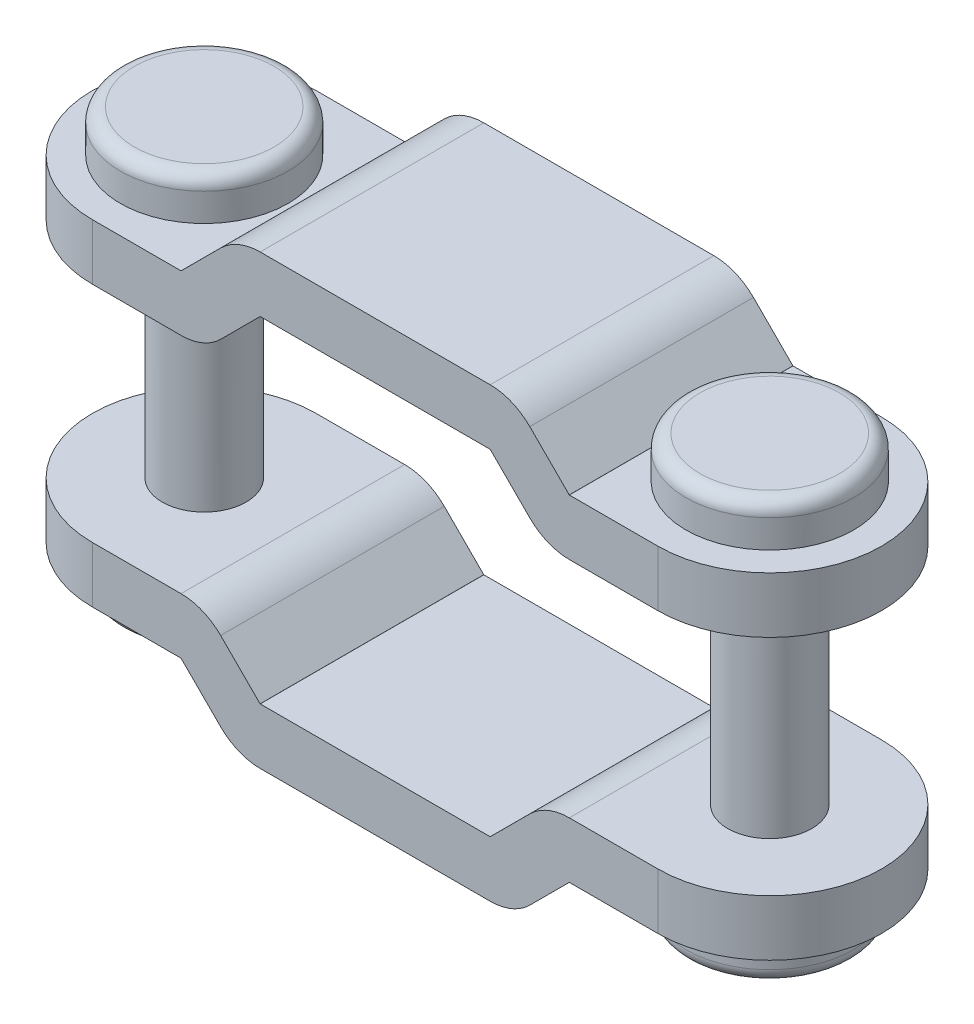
ISO-10303-21;
HEADER;
FILE_DESCRIPTION(('STEP AP214'),'2;1');
FILE_NAME('part.step','',(''),(''),'','','');
FILE_SCHEMA(('AUTOMOTIVE_DESIGN { 1 0 10303 214 1 1 1 1 }'));
ENDSEC;
DATA;
#1=APPLICATION_CONTEXT('core data for automotive mechanical design processes');
#2=APPLICATION_PROTOCOL_DEFINITION('international standard','automotive_design',2000,#1);
#3=PRODUCT_CONTEXT('',#1,'mechanical');
#4=PRODUCT('Part','Part','',(#3));
#5=PRODUCT_RELATED_PRODUCT_CATEGORY('part','',(#4));
#6=PRODUCT_DEFINITION_FORMATION('','',#4);
#7=PRODUCT_DEFINITION_CONTEXT('part definition',#1,'design');
#8=PRODUCT_DEFINITION('design','',#6,#7);
#9=PRODUCT_DEFINITION_SHAPE('','',#8);
#10=(LENGTH_UNIT() NAMED_UNIT(*) SI_UNIT(.MILLI.,.METRE.));
#11=(NAMED_UNIT(*) PLANE_ANGLE_UNIT() SI_UNIT($,.RADIAN.));
#12=(NAMED_UNIT(*) SI_UNIT($,.STERADIAN.) SOLID_ANGLE_UNIT());
#13=UNCERTAINTY_MEASURE_WITH_UNIT(LENGTH_MEASURE(1.E-05),#10,'distance_accuracy_value','');
#14=(GEOMETRIC_REPRESENTATION_CONTEXT(3) GLOBAL_UNCERTAINTY_ASSIGNED_CONTEXT((#13)) GLOBAL_UNIT_ASSIGNED_CONTEXT((#10,
#11,#12)) REPRESENTATION_CONTEXT('',''));
#15=CARTESIAN_POINT('',(0.,0.,0.));
#16=DIRECTION('',(0.,0.,1.));
#17=DIRECTION('',(1.,0.,0.));
#18=AXIS2_PLACEMENT_3D('',#15,#16,#17);
#19=CARTESIAN_POINT('',(-8.,-12.,8.));
#20=DIRECTION('',(0.,1.,0.));
#21=DIRECTION('',(0.,0.,1.));
#22=AXIS2_PLACEMENT_3D('',#19,#20,#21);
#23=PLANE('',#22);
#24=CARTESIAN_POINT('',(0.,-12.,0.));
#25=DIRECTION('',(0.,1.,0.));
#26=DIRECTION('',(0.,0.,1.));
#27=AXIS2_PLACEMENT_3D('',#24,#25,#26);
#28=CIRCLE('',#27,8.);
#29=CARTESIAN_POINT('',(0.,-12.,-8.));
#30=VERTEX_POINT('',#29);
#31=CARTESIAN_POINT('',(0.,-12.,8.));
#32=VERTEX_POINT('',#31);
#33=EDGE_CURVE('E740',#30,#32,#28,.T.);
#34=ORIENTED_EDGE('',*,*,#33,.F.);
#35=DIRECTION('',(1.,0.,0.));
#36=VECTOR('',#35,1.);
#37=CARTESIAN_POINT('',(-8.,-12.,-8.));
#38=LINE('',#37,#36);
#39=CARTESIAN_POINT('',(6.33900361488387,-12.,-8.));
#40=VERTEX_POINT('',#39);
#41=EDGE_CURVE('E737',#40,#30,#38,.F.);
#42=ORIENTED_EDGE('',*,*,#41,.F.);
#43=DIRECTION('',(0.,0.,-1.));
#44=VECTOR('',#43,1.);
#45=CARTESIAN_POINT('',(6.33900361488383,-12.,8.));
#46=LINE('',#45,#44);
#47=CARTESIAN_POINT('',(6.33900361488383,-12.,8.));
#48=VERTEX_POINT('',#47);
#49=EDGE_CURVE('E733',#40,#48,#46,.F.);
#50=ORIENTED_EDGE('',*,*,#49,.T.);
#51=DIRECTION('',(1.,0.,0.));
#52=VECTOR('',#51,1.);
#53=CARTESIAN_POINT('',(-8.,-12.,8.));
#54=LINE('',#53,#52);
#55=EDGE_CURVE('E741',#32,#48,#54,.T.);
#56=ORIENTED_EDGE('',*,*,#55,.F.);
#57=EDGE_LOOP('',(#34,#42,#50,#56));
#58=FACE_BOUND('',#57,.T.);
#59=CARTESIAN_POINT('',(0.,-12.,0.));
#60=DIRECTION('',(0.,1.,0.));
#61=DIRECTION('',(-1.,0.,0.));
#62=AXIS2_PLACEMENT_3D('',#59,#60,#61);
#63=CIRCLE('',#62,6.);
#64=CARTESIAN_POINT('',(-6.,-12.,0.));
#65=VERTEX_POINT('',#64);
#66=EDGE_CURVE('E11',#65,#65,#63,.T.);
#67=ORIENTED_EDGE('',*,*,#66,.T.);
#68=EDGE_LOOP('',(#67));
#69=FACE_BOUND('',#68,.T.);
#70=ADVANCED_FACE('F17',(#58,#69),#23,.F.);
#71=CARTESIAN_POINT('',(48.46,-12.,8.));
#72=DIRECTION('',(0.,1.,0.));
#73=DIRECTION('',(0.,0.,1.));
#74=AXIS2_PLACEMENT_3D('',#71,#72,#73);
#75=PLANE('',#74);
#76=CARTESIAN_POINT('',(40.46,-12.,0.));
#77=DIRECTION('',(0.,-1.,0.));
#78=DIRECTION('',(0.,0.,1.));
#79=AXIS2_PLACEMENT_3D('',#76,#77,#78);
#80=CIRCLE('',#79,8.);
#81=CARTESIAN_POINT('',(40.46,-12.,-8.));
#82=VERTEX_POINT('',#81);
#83=CARTESIAN_POINT('',(40.46,-12.,8.));
#84=VERTEX_POINT('',#83);
#85=EDGE_CURVE('E621',#82,#84,#80,.T.);
#86=ORIENTED_EDGE('',*,*,#85,.T.);
#87=DIRECTION('',(-1.,0.,0.));
#88=VECTOR('',#87,1.);
#89=CARTESIAN_POINT('',(48.46,-12.,8.));
#90=LINE('',#89,#88);
#91=CARTESIAN_POINT('',(34.1209963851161,-12.,8.));
#92=VERTEX_POINT('',#91);
#93=EDGE_CURVE('E629',#84,#92,#90,.T.);
#94=ORIENTED_EDGE('',*,*,#93,.T.);
#95=DIRECTION('',(0.,0.,-1.));
#96=VECTOR('',#95,1.);
#97=CARTESIAN_POINT('',(34.1209963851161,-12.,8.));
#98=LINE('',#97,#96);
#99=CARTESIAN_POINT('',(34.1209963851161,-12.,-8.));
#100=VERTEX_POINT('',#99);
#101=EDGE_CURVE('E626',#100,#92,#98,.F.);
#102=ORIENTED_EDGE('',*,*,#101,.F.);
#103=DIRECTION('',(-1.,0.,0.));
#104=VECTOR('',#103,1.);
#105=CARTESIAN_POINT('',(48.46,-12.,-8.));
#106=LINE('',#105,#104);
#107=EDGE_CURVE('E623',#100,#82,#106,.F.);
#108=ORIENTED_EDGE('',*,*,#107,.T.);
#109=EDGE_LOOP('',(#86,#94,#102,#108));
#110=FACE_BOUND('',#109,.T.);
#111=CARTESIAN_POINT('',(40.46,-12.,1.05718673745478E-06));
#112=DIRECTION('',(0.,1.,0.));
#113=DIRECTION('',(-1.,0.,0.));
#114=AXIS2_PLACEMENT_3D('',#111,#112,#113);
#115=CIRCLE('',#114,6.);
#116=CARTESIAN_POINT('',(34.46,-12.,1.05718673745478E-06));
#117=VERTEX_POINT('',#116);
#118=EDGE_CURVE('E26',#117,#117,#115,.T.);
#119=ORIENTED_EDGE('',*,*,#118,.T.);
#120=EDGE_LOOP('',(#119));
#121=FACE_BOUND('',#120,.T.);
#122=ADVANCED_FACE('F366',(#110,#121),#75,.F.);
#123=CARTESIAN_POINT('',(48.46,12.,-8.));
#124=DIRECTION('',(0.,-1.,0.));
#125=DIRECTION('',(0.,0.,-1.));
#126=AXIS2_PLACEMENT_3D('',#123,#124,#125);
#127=PLANE('',#126);
#128=CARTESIAN_POINT('',(40.46,12.,0.));
#129=DIRECTION('',(0.,1.,0.));
#130=DIRECTION('',(0.,0.,-1.));
#131=AXIS2_PLACEMENT_3D('',#128,#129,#130);
#132=CIRCLE('',#131,8.);
#133=CARTESIAN_POINT('',(40.46,12.,8.));
#134=VERTEX_POINT('',#133);
#135=CARTESIAN_POINT('',(40.46,12.,-8.));
#136=VERTEX_POINT('',#135);
#137=EDGE_CURVE('E780',#134,#136,#132,.T.);
#138=ORIENTED_EDGE('',*,*,#137,.T.);
#139=DIRECTION('',(-1.,0.,0.));
#140=VECTOR('',#139,1.);
#141=CARTESIAN_POINT('',(48.46,12.,-8.));
#142=LINE('',#141,#140);
#143=CARTESIAN_POINT('',(34.1209963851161,12.,-8.));
#144=VERTEX_POINT('',#143);
#145=EDGE_CURVE('E788',#136,#144,#142,.T.);
#146=ORIENTED_EDGE('',*,*,#145,.T.);
#147=DIRECTION('',(0.,0.,1.));
#148=VECTOR('',#147,1.);
#149=CARTESIAN_POINT('',(34.1209963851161,12.,-8.));
#150=LINE('',#149,#148);
#151=CARTESIAN_POINT('',(34.1209963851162,12.,8.));
#152=VERTEX_POINT('',#151);
#153=EDGE_CURVE('E785',#152,#144,#150,.F.);
#154=ORIENTED_EDGE('',*,*,#153,.F.);
#155=DIRECTION('',(-1.,0.,0.));
#156=VECTOR('',#155,1.);
#157=CARTESIAN_POINT('',(48.46,12.,8.));
#158=LINE('',#157,#156);
#159=EDGE_CURVE('E782',#152,#134,#158,.F.);
#160=ORIENTED_EDGE('',*,*,#159,.T.);
#161=EDGE_LOOP('',(#138,#146,#154,#160));
#162=FACE_BOUND('',#161,.T.);
#163=CARTESIAN_POINT('',(40.46,12.,1.05718673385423E-06));
#164=DIRECTION('',(0.,-1.,0.));
#165=DIRECTION('',(1.,0.,0.));
#166=AXIS2_PLACEMENT_3D('',#163,#164,#165);
#167=CIRCLE('',#166,6.);
#168=CARTESIAN_POINT('',(46.46,12.,1.05718673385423E-06));
#169=VERTEX_POINT('',#168);
#170=EDGE_CURVE('E360',#169,#169,#167,.T.);
#171=ORIENTED_EDGE('',*,*,#170,.T.);
#172=EDGE_LOOP('',(#171));
#173=FACE_BOUND('',#172,.T.);
#174=ADVANCED_FACE('F391',(#162,#173),#127,.F.);
#175=CARTESIAN_POINT('',(-8.,12.,-8.));
#176=DIRECTION('',(0.,-1.,0.));
#177=DIRECTION('',(0.,0.,-1.));
#178=AXIS2_PLACEMENT_3D('',#175,#176,#177);
#179=PLANE('',#178);
#180=CARTESIAN_POINT('',(0.,12.,0.));
#181=DIRECTION('',(0.,-1.,0.));
#182=DIRECTION('',(0.,0.,-1.));
#183=AXIS2_PLACEMENT_3D('',#180,#181,#182);
#184=CIRCLE('',#183,8.);
#185=CARTESIAN_POINT('',(0.,12.,8.));
#186=VERTEX_POINT('',#185);
#187=CARTESIAN_POINT('',(0.,12.,-8.));
#188=VERTEX_POINT('',#187);
#189=EDGE_CURVE('E355',#186,#188,#184,.T.);
#190=ORIENTED_EDGE('',*,*,#189,.F.);
#191=DIRECTION('',(1.,0.,0.));
#192=VECTOR('',#191,1.);
#193=CARTESIAN_POINT('',(-8.,12.,8.));
#194=LINE('',#193,#192);
#195=CARTESIAN_POINT('',(6.33900361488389,12.,8.));
#196=VERTEX_POINT('',#195);
#197=EDGE_CURVE('E316',#196,#186,#194,.F.);
#198=ORIENTED_EDGE('',*,*,#197,.F.);
#199=DIRECTION('',(0.,0.,1.));
#200=VECTOR('',#199,1.);
#201=CARTESIAN_POINT('',(6.33900361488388,12.,-8.));
#202=LINE('',#201,#200);
#203=CARTESIAN_POINT('',(6.33900361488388,12.,-8.));
#204=VERTEX_POINT('',#203);
#205=EDGE_CURVE('E349',#196,#204,#202,.F.);
#206=ORIENTED_EDGE('',*,*,#205,.T.);
#207=DIRECTION('',(1.,0.,0.));
#208=VECTOR('',#207,1.);
#209=CARTESIAN_POINT('',(-8.,12.,-8.));
#210=LINE('',#209,#208);
#211=EDGE_CURVE('E323',#188,#204,#210,.T.);
#212=ORIENTED_EDGE('',*,*,#211,.F.);
#213=EDGE_LOOP('',(#190,#198,#206,#212));
#214=FACE_BOUND('',#213,.T.);
#215=CARTESIAN_POINT('',(0.,12.,0.));
#216=DIRECTION('',(0.,-1.,0.));
#217=DIRECTION('',(1.,0.,0.));
#218=AXIS2_PLACEMENT_3D('',#215,#216,#217);
#219=CIRCLE('',#218,6.);
#220=CARTESIAN_POINT('',(6.,12.,0.));
#221=VERTEX_POINT('',#220);
#222=EDGE_CURVE('E357',#221,#221,#219,.T.);
#223=ORIENTED_EDGE('',*,*,#222,.T.);
#224=EDGE_LOOP('',(#223));
#225=FACE_BOUND('',#224,.T.);
#226=ADVANCED_FACE('F423',(#214,#225),#179,.F.);
#227=CARTESIAN_POINT('',(0.,12.,0.));
#228=DIRECTION('',(0.,-1.,0.));
#229=DIRECTION('',(0.688317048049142,0.,-0.725409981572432));
#230=AXIS2_PLACEMENT_3D('',#227,#228,#229);
#231=CYLINDRICAL_SURFACE('',#230,3.);
#232=CARTESIAN_POINT('',(0.,8.,0.));
#233=DIRECTION('',(0.,-1.,0.));
#234=DIRECTION('',(-1.29851666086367E-08,0.,-1.));
#235=AXIS2_PLACEMENT_3D('',#232,#233,#234);
#236=CIRCLE('',#235,3.);
#237=CARTESIAN_POINT('',(-3.89554998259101E-08,8.,-3.));
#238=VERTEX_POINT('',#237);
#239=EDGE_CURVE('E361',#238,#238,#236,.F.);
#240=ORIENTED_EDGE('',*,*,#239,.F.);
#241=EDGE_LOOP('',(#240));
#242=FACE_BOUND('',#241,.T.);
#243=CARTESIAN_POINT('',(0.,-8.,0.));
#244=DIRECTION('',(0.,1.,0.));
#245=DIRECTION('',(1.29851666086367E-08,0.,1.));
#246=AXIS2_PLACEMENT_3D('',#243,#244,#245);
#247=CIRCLE('',#246,3.);
#248=CARTESIAN_POINT('',(3.89554998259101E-08,-8.,3.));
#249=VERTEX_POINT('',#248);
#250=EDGE_CURVE('E522',#249,#249,#247,.F.);
#251=ORIENTED_EDGE('',*,*,#250,.F.);
#252=EDGE_LOOP('',(#251));
#253=FACE_BOUND('',#252,.T.);
#254=ADVANCED_FACE('F486',(#242,#253),#231,.T.);
#255=CARTESIAN_POINT('',(40.46,12.,1.05718673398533E-06));
#256=DIRECTION('',(0.,-1.,0.));
#257=DIRECTION('',(0.808409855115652,0.,-0.588620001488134));
#258=AXIS2_PLACEMENT_3D('',#255,#256,#257);
#259=CYLINDRICAL_SURFACE('',#258,3.);
#260=CARTESIAN_POINT('',(40.46,-8.,1.05718673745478E-06));
#261=DIRECTION('',(0.,1.,0.));
#262=DIRECTION('',(1.29851666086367E-08,0.,1.));
#263=AXIS2_PLACEMENT_3D('',#260,#261,#262);
#264=CIRCLE('',#263,3.);
#265=CARTESIAN_POINT('',(40.4600000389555,-8.,3.00000105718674));
#266=VERTEX_POINT('',#265);
#267=EDGE_CURVE('E605',#266,#266,#264,.F.);
#268=ORIENTED_EDGE('',*,*,#267,.F.);
#269=EDGE_LOOP('',(#268));
#270=FACE_BOUND('',#269,.T.);
#271=CARTESIAN_POINT('',(40.46,8.,1.05718673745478E-06));
#272=DIRECTION('',(0.,-1.,0.));
#273=DIRECTION('',(-1.29851666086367E-08,0.,-1.));
#274=AXIS2_PLACEMENT_3D('',#271,#272,#273);
#275=CIRCLE('',#274,3.);
#276=CARTESIAN_POINT('',(40.4599999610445,8.,-2.99999894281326));
#277=VERTEX_POINT('',#276);
#278=EDGE_CURVE('E597',#277,#277,#275,.F.);
#279=ORIENTED_EDGE('',*,*,#278,.F.);
#280=EDGE_LOOP('',(#279));
#281=FACE_BOUND('',#280,.T.);
#282=ADVANCED_FACE('F488',(#270,#281),#259,.T.);
#283=CARTESIAN_POINT('',(12.0041421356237,-11.99,8.));
#284=DIRECTION('',(0.,0.,-1.));
#285=DIRECTION('',(0.,1.,0.));
#286=AXIS2_PLACEMENT_3D('',#283,#284,#285);
#287=CYLINDRICAL_SURFACE('',#286,4.01);
#288=CARTESIAN_POINT('',(12.0041421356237,-11.99,8.));
#289=DIRECTION('',(0.,0.,-1.));
#290=DIRECTION('',(0.,1.,0.));
#291=AXIS2_PLACEMENT_3D('',#288,#289,#290);
#292=CIRCLE('',#291,4.01);
#293=CARTESIAN_POINT('',(12.0041421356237,-16.,8.));
#294=VERTEX_POINT('',#293);
#295=CARTESIAN_POINT('',(9.16864394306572,-14.8254981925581,8.));
#296=VERTEX_POINT('',#295);
#297=EDGE_CURVE('E713',#294,#296,#292,.T.);
#298=ORIENTED_EDGE('',*,*,#297,.T.);
#299=DIRECTION('',(0.,0.,-1.));
#300=VECTOR('',#299,1.);
#301=CARTESIAN_POINT('',(9.16864394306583,-14.8254981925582,8.));
#302=LINE('',#301,#300);
#303=CARTESIAN_POINT('',(9.16864394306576,-14.8254981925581,-8.));
#304=VERTEX_POINT('',#303);
#305=EDGE_CURVE('E705',#296,#304,#302,.T.);
#306=ORIENTED_EDGE('',*,*,#305,.T.);
#307=CARTESIAN_POINT('',(12.0041421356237,-11.99,-8.));
#308=DIRECTION('',(0.,0.,-1.));
#309=DIRECTION('',(0.,1.,0.));
#310=AXIS2_PLACEMENT_3D('',#307,#308,#309);
#311=CIRCLE('',#310,4.01);
#312=CARTESIAN_POINT('',(12.0041421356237,-16.,-8.));
#313=VERTEX_POINT('',#312);
#314=EDGE_CURVE('E701',#304,#313,#311,.F.);
#315=ORIENTED_EDGE('',*,*,#314,.T.);
#316=DIRECTION('',(0.,0.,1.));
#317=VECTOR('',#316,1.);
#318=CARTESIAN_POINT('',(12.0041421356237,-16.,8.));
#319=LINE('',#318,#317);
#320=EDGE_CURVE('E689',#313,#294,#319,.T.);
#321=ORIENTED_EDGE('',*,*,#320,.T.);
#322=EDGE_LOOP('',(#298,#306,#315,#321));
#323=FACE_BOUND('',#322,.T.);
#324=ADVANCED_FACE('F919',(#323),#287,.T.);
#325=CARTESIAN_POINT('',(5.17157287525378,-10.8284271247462,8.));
#326=DIRECTION('',(0.707106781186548,0.707106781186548,0.));
#327=DIRECTION('',(-0.707106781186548,0.707106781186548,0.));
#328=AXIS2_PLACEMENT_3D('',#325,#326,#327);
#329=PLANE('',#328);
#330=ORIENTED_EDGE('',*,*,#305,.F.);
#331=DIRECTION('',(-0.707106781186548,0.707106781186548,0.));
#332=VECTOR('',#331,1.);
#333=CARTESIAN_POINT('',(5.17157287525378,-10.8284271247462,8.));
#334=LINE('',#333,#332);
#335=CARTESIAN_POINT('',(6.34607468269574,-12.0029289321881,8.));
#336=VERTEX_POINT('',#335);
#337=EDGE_CURVE('E706',#336,#296,#334,.F.);
#338=ORIENTED_EDGE('',*,*,#337,.F.);
#339=DIRECTION('',(0.,0.,1.));
#340=VECTOR('',#339,1.);
#341=CARTESIAN_POINT('',(6.34607468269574,-12.0029289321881,8.));
#342=LINE('',#341,#340);
#343=CARTESIAN_POINT('',(6.34607468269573,-12.0029289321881,-8.));
#344=VERTEX_POINT('',#343);
#345=EDGE_CURVE('E710',#344,#336,#342,.T.);
#346=ORIENTED_EDGE('',*,*,#345,.F.);
#347=DIRECTION('',(-0.707106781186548,0.707106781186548,0.));
#348=VECTOR('',#347,1.);
#349=CARTESIAN_POINT('',(5.17157287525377,-10.8284271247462,-8.));
#350=LINE('',#349,#348);
#351=EDGE_CURVE('E709',#304,#344,#350,.T.);
#352=ORIENTED_EDGE('',*,*,#351,.F.);
#353=EDGE_LOOP('',(#330,#338,#346,#352));
#354=FACE_BOUND('',#353,.T.);
#355=ADVANCED_FACE('F926',(#354),#329,.F.);
#356=CARTESIAN_POINT('',(8.,-8.,8.));
#357=DIRECTION('',(0.707106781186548,0.707106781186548,0.));
#358=DIRECTION('',(-0.707106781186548,0.707106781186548,0.));
#359=AXIS2_PLACEMENT_3D('',#356,#357,#358);
#360=PLANE('',#359);
#361=DIRECTION('',(-0.707106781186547,0.707106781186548,0.));
#362=VECTOR('',#361,1.);
#363=CARTESIAN_POINT('',(11.9970710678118,-11.9970710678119,8.));
#364=LINE('',#363,#362);
#365=CARTESIAN_POINT('',(11.9970710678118,-11.9970710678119,8.));
#366=VERTEX_POINT('',#365);
#367=CARTESIAN_POINT('',(9.17450180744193,-9.17450180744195,8.));
#368=VERTEX_POINT('',#367);
#369=EDGE_CURVE('E720',#366,#368,#364,.T.);
#370=ORIENTED_EDGE('',*,*,#369,.F.);
#371=DIRECTION('',(0.,0.,-1.));
#372=VECTOR('',#371,1.);
#373=CARTESIAN_POINT('',(11.9970710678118,-11.9970710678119,8.));
#374=LINE('',#373,#372);
#375=CARTESIAN_POINT('',(11.9970710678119,-11.9970710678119,-8.));
#376=VERTEX_POINT('',#375);
#377=EDGE_CURVE('E723',#366,#376,#374,.T.);
#378=ORIENTED_EDGE('',*,*,#377,.T.);
#379=DIRECTION('',(0.707106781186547,-0.707106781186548,0.));
#380=VECTOR('',#379,1.);
#381=CARTESIAN_POINT('',(9.17450180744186,-9.17450180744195,-8.));
#382=LINE('',#381,#380);
#383=CARTESIAN_POINT('',(9.17450180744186,-9.17450180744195,-8.));
#384=VERTEX_POINT('',#383);
#385=EDGE_CURVE('E716',#384,#376,#382,.T.);
#386=ORIENTED_EDGE('',*,*,#385,.F.);
#387=DIRECTION('',(0.,0.,1.));
#388=VECTOR('',#387,1.);
#389=CARTESIAN_POINT('',(9.17450180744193,-9.17450180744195,8.));
#390=LINE('',#389,#388);
#391=EDGE_CURVE('E729',#384,#368,#390,.T.);
#392=ORIENTED_EDGE('',*,*,#391,.T.);
#393=EDGE_LOOP('',(#370,#378,#386,#392));
#394=FACE_BOUND('',#393,.T.);
#395=ADVANCED_FACE('F397',(#394),#360,.T.);
#396=CARTESIAN_POINT('',(12.0041421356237,-11.99,8.));
#397=DIRECTION('',(0.,0.,-1.));
#398=DIRECTION('',(0.,1.,0.));
#399=AXIS2_PLACEMENT_3D('',#396,#397,#398);
#400=CYLINDRICAL_SURFACE('',#399,0.00999999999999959);
#401=ORIENTED_EDGE('',*,*,#377,.F.);
#402=CARTESIAN_POINT('',(12.0041421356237,-11.99,8.));
#403=DIRECTION('',(0.,0.,1.));
#404=DIRECTION('',(0.,-1.,0.));
#405=AXIS2_PLACEMENT_3D('',#402,#403,#404);
#406=CIRCLE('',#405,0.00999999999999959);
#407=CARTESIAN_POINT('',(12.0041421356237,-12.,8.));
#408=VERTEX_POINT('',#407);
#409=EDGE_CURVE('E702',#408,#366,#406,.F.);
#410=ORIENTED_EDGE('',*,*,#409,.F.);
#411=DIRECTION('',(0.,0.,1.));
#412=VECTOR('',#411,1.);
#413=CARTESIAN_POINT('',(12.0041421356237,-12.,8.));
#414=LINE('',#413,#412);
#415=CARTESIAN_POINT('',(12.0041421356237,-12.,-8.));
#416=VERTEX_POINT('',#415);
#417=EDGE_CURVE('E698',#416,#408,#414,.T.);
#418=ORIENTED_EDGE('',*,*,#417,.F.);
#419=CARTESIAN_POINT('',(12.0041421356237,-11.99,-8.));
#420=DIRECTION('',(0.,0.,-1.));
#421=DIRECTION('',(0.,1.,0.));
#422=AXIS2_PLACEMENT_3D('',#419,#420,#421);
#423=CIRCLE('',#422,0.00999999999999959);
#424=EDGE_CURVE('E719',#376,#416,#423,.F.);
#425=ORIENTED_EDGE('',*,*,#424,.F.);
#426=EDGE_LOOP('',(#401,#410,#418,#425));
#427=FACE_BOUND('',#426,.T.);
#428=ADVANCED_FACE('F983',(#427),#400,.F.);
#429=CARTESIAN_POINT('',(12.,-12.,8.));
#430=DIRECTION('',(0.,1.,0.));
#431=DIRECTION('',(0.,0.,1.));
#432=AXIS2_PLACEMENT_3D('',#429,#430,#431);
#433=PLANE('',#432);
#434=DIRECTION('',(1.,0.,0.));
#435=VECTOR('',#434,1.);
#436=CARTESIAN_POINT('',(9.16864394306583,-12.,8.));
#437=LINE('',#436,#435);
#438=CARTESIAN_POINT('',(28.4558578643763,-12.,8.));
#439=VERTEX_POINT('',#438);
#440=EDGE_CURVE('E697',#439,#408,#437,.F.);
#441=ORIENTED_EDGE('',*,*,#440,.F.);
#442=DIRECTION('',(0.,0.,1.));
#443=VECTOR('',#442,1.);
#444=CARTESIAN_POINT('',(28.4558578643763,-12.,8.));
#445=LINE('',#444,#443);
#446=CARTESIAN_POINT('',(28.4558578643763,-12.,-8.));
#447=VERTEX_POINT('',#446);
#448=EDGE_CURVE('E664',#447,#439,#445,.T.);
#449=ORIENTED_EDGE('',*,*,#448,.F.);
#450=DIRECTION('',(1.,0.,0.));
#451=VECTOR('',#450,1.);
#452=CARTESIAN_POINT('',(31.2367784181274,-12.,-8.));
#453=LINE('',#452,#451);
#454=EDGE_CURVE('E693',#416,#447,#453,.T.);
#455=ORIENTED_EDGE('',*,*,#454,.F.);
#456=ORIENTED_EDGE('',*,*,#417,.T.);
#457=EDGE_LOOP('',(#441,#449,#455,#456));
#458=FACE_BOUND('',#457,.T.);
#459=ADVANCED_FACE('F958',(#458),#433,.T.);
#460=CARTESIAN_POINT('',(28.4558578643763,-11.99,8.));
#461=DIRECTION('',(0.,0.,-1.));
#462=DIRECTION('',(0.,1.,0.));
#463=AXIS2_PLACEMENT_3D('',#460,#461,#462);
#464=CYLINDRICAL_SURFACE('',#463,0.00999999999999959);
#465=DIRECTION('',(0.,0.,-1.));
#466=VECTOR('',#465,1.);
#467=CARTESIAN_POINT('',(28.4629289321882,-11.9970710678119,8.));
#468=LINE('',#467,#466);
#469=CARTESIAN_POINT('',(28.4629289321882,-11.9970710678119,8.));
#470=VERTEX_POINT('',#469);
#471=CARTESIAN_POINT('',(28.462928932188,-11.9970710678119,-8.));
#472=VERTEX_POINT('',#471);
#473=EDGE_CURVE('E659',#470,#472,#468,.T.);
#474=ORIENTED_EDGE('',*,*,#473,.T.);
#475=CARTESIAN_POINT('',(28.4558578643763,-11.99,-8.));
#476=DIRECTION('',(0.,0.,1.));
#477=DIRECTION('',(0.,1.,0.));
#478=AXIS2_PLACEMENT_3D('',#475,#476,#477);
#479=CIRCLE('',#478,0.00999999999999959);
#480=EDGE_CURVE('E667',#472,#447,#479,.F.);
#481=ORIENTED_EDGE('',*,*,#480,.T.);
#482=ORIENTED_EDGE('',*,*,#448,.T.);
#483=CARTESIAN_POINT('',(28.4558578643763,-11.99,8.));
#484=DIRECTION('',(0.,0.,-1.));
#485=DIRECTION('',(0.,-1.,0.));
#486=AXIS2_PLACEMENT_3D('',#483,#484,#485);
#487=CIRCLE('',#486,0.00999999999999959);
#488=EDGE_CURVE('E637',#439,#470,#487,.F.);
#489=ORIENTED_EDGE('',*,*,#488,.T.);
#490=EDGE_LOOP('',(#474,#481,#482,#489));
#491=FACE_BOUND('',#490,.T.);
#492=ADVANCED_FACE('F954',(#491),#464,.F.);
#493=CARTESIAN_POINT('',(32.46,-8.,8.));
#494=DIRECTION('',(-0.707106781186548,0.707106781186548,0.));
#495=DIRECTION('',(0.707106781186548,0.707106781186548,0.));
#496=AXIS2_PLACEMENT_3D('',#493,#494,#495);
#497=PLANE('',#496);
#498=DIRECTION('',(0.707106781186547,0.707106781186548,0.));
#499=VECTOR('',#498,1.);
#500=CARTESIAN_POINT('',(28.4629289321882,-11.9970710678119,8.));
#501=LINE('',#500,#499);
#502=CARTESIAN_POINT('',(31.2854981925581,-9.17450180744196,8.));
#503=VERTEX_POINT('',#502);
#504=EDGE_CURVE('E640',#470,#503,#501,.T.);
#505=ORIENTED_EDGE('',*,*,#504,.T.);
#506=DIRECTION('',(0.,0.,1.));
#507=VECTOR('',#506,1.);
#508=CARTESIAN_POINT('',(31.2854981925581,-9.17450180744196,8.));
#509=LINE('',#508,#507);
#510=CARTESIAN_POINT('',(31.2854981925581,-9.17450180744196,-8.));
#511=VERTEX_POINT('',#510);
#512=EDGE_CURVE('E653',#511,#503,#509,.T.);
#513=ORIENTED_EDGE('',*,*,#512,.F.);
#514=DIRECTION('',(-0.707106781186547,-0.707106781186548,0.));
#515=VECTOR('',#514,1.);
#516=CARTESIAN_POINT('',(31.2854981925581,-9.17450180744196,-8.));
#517=LINE('',#516,#515);
#518=EDGE_CURVE('E661',#511,#472,#517,.T.);
#519=ORIENTED_EDGE('',*,*,#518,.T.);
#520=ORIENTED_EDGE('',*,*,#473,.F.);
#521=EDGE_LOOP('',(#505,#513,#519,#520));
#522=FACE_BOUND('',#521,.T.);
#523=ADVANCED_FACE('F946',(#522),#497,.T.);
#524=CARTESIAN_POINT('',(34.1209963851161,-12.01,8.));
#525=DIRECTION('',(0.,0.,-1.));
#526=DIRECTION('',(0.,1.,0.));
#527=AXIS2_PLACEMENT_3D('',#524,#525,#526);
#528=CYLINDRICAL_SURFACE('',#527,4.01);
#529=CARTESIAN_POINT('',(34.1209963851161,-12.01,8.));
#530=DIRECTION('',(0.,0.,1.));
#531=DIRECTION('',(0.,1.,0.));
#532=AXIS2_PLACEMENT_3D('',#529,#530,#531);
#533=CIRCLE('',#532,4.01);
#534=CARTESIAN_POINT('',(34.1209963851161,-8.,8.));
#535=VERTEX_POINT('',#534);
#536=EDGE_CURVE('E643',#503,#535,#533,.F.);
#537=ORIENTED_EDGE('',*,*,#536,.T.);
#538=DIRECTION('',(0.,0.,-1.));
#539=VECTOR('',#538,1.);
#540=CARTESIAN_POINT('',(34.1209963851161,-8.,8.));
#541=LINE('',#540,#539);
#542=CARTESIAN_POINT('',(34.1209963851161,-8.,-8.));
#543=VERTEX_POINT('',#542);
#544=EDGE_CURVE('E612',#543,#535,#541,.F.);
#545=ORIENTED_EDGE('',*,*,#544,.F.);
#546=CARTESIAN_POINT('',(34.1209963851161,-12.01,-8.));
#547=DIRECTION('',(0.,0.,1.));
#548=DIRECTION('',(0.,1.,0.));
#549=AXIS2_PLACEMENT_3D('',#546,#547,#548);
#550=CIRCLE('',#549,4.01);
#551=EDGE_CURVE('E656',#543,#511,#550,.T.);
#552=ORIENTED_EDGE('',*,*,#551,.T.);
#553=ORIENTED_EDGE('',*,*,#512,.T.);
#554=EDGE_LOOP('',(#537,#545,#552,#553));
#555=FACE_BOUND('',#554,.T.);
#556=ADVANCED_FACE('F935',(#555),#528,.T.);
#557=CARTESIAN_POINT('',(48.46,-8.,8.));
#558=DIRECTION('',(0.,1.,0.));
#559=DIRECTION('',(0.,0.,1.));
#560=AXIS2_PLACEMENT_3D('',#557,#558,#559);
#561=PLANE('',#560);
#562=DIRECTION('',(-1.,0.,0.));
#563=VECTOR('',#562,1.);
#564=CARTESIAN_POINT('',(6.38370803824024,-8.,8.));
#565=LINE('',#564,#563);
#566=CARTESIAN_POINT('',(40.46,-8.,8.));
#567=VERTEX_POINT('',#566);
#568=EDGE_CURVE('E609',#535,#567,#565,.F.);
#569=ORIENTED_EDGE('',*,*,#568,.T.);
#570=CARTESIAN_POINT('',(40.46,-8.,0.));
#571=DIRECTION('',(0.,-1.,0.));
#572=DIRECTION('',(0.,0.,1.));
#573=AXIS2_PLACEMENT_3D('',#570,#571,#572);
#574=CIRCLE('',#573,8.);
#575=CARTESIAN_POINT('',(40.46,-8.,-8.));
#576=VERTEX_POINT('',#575);
#577=EDGE_CURVE('E619',#567,#576,#574,.F.);
#578=ORIENTED_EDGE('',*,*,#577,.T.);
#579=DIRECTION('',(-1.,0.,0.));
#580=VECTOR('',#579,1.);
#581=CARTESIAN_POINT('',(34.1139253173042,-8.,-8.));
#582=LINE('',#581,#580);
#583=EDGE_CURVE('E616',#576,#543,#582,.T.);
#584=ORIENTED_EDGE('',*,*,#583,.T.);
#585=ORIENTED_EDGE('',*,*,#544,.T.);
#586=EDGE_LOOP('',(#569,#578,#584,#585));
#587=FACE_BOUND('',#586,.T.);
#588=ORIENTED_EDGE('',*,*,#267,.T.);
#589=EDGE_LOOP('',(#588));
#590=FACE_BOUND('',#589,.T.);
#591=ADVANCED_FACE('F932',(#587,#590),#561,.T.);
#592=CARTESIAN_POINT('',(40.46,-12.,0.));
#593=DIRECTION('',(0.,1.,0.));
#594=DIRECTION('',(0.,0.,1.));
#595=AXIS2_PLACEMENT_3D('',#592,#593,#594);
#596=CYLINDRICAL_SURFACE('',#595,8.);
#597=DIRECTION('',(0.,-1.,0.));
#598=VECTOR('',#597,1.);
#599=CARTESIAN_POINT('',(40.46,-12.16,8.));
#600=LINE('',#599,#598);
#601=EDGE_CURVE('E631',#567,#84,#600,.T.);
#602=ORIENTED_EDGE('',*,*,#601,.T.);
#603=ORIENTED_EDGE('',*,*,#85,.F.);
#604=DIRECTION('',(0.,1.,0.));
#605=VECTOR('',#604,1.);
#606=CARTESIAN_POINT('',(40.46,-12.0029289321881,-8.));
#607=LINE('',#606,#605);
#608=EDGE_CURVE('E634',#82,#576,#607,.T.);
#609=ORIENTED_EDGE('',*,*,#608,.T.);
#610=ORIENTED_EDGE('',*,*,#577,.F.);
#611=EDGE_LOOP('',(#602,#603,#609,#610));
#612=FACE_BOUND('',#611,.T.);
#613=ADVANCED_FACE('F934',(#612),#596,.T.);
#614=CARTESIAN_POINT('',(34.1209963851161,-12.01,8.));
#615=DIRECTION('',(0.,0.,-1.));
#616=DIRECTION('',(0.,1.,0.));
#617=AXIS2_PLACEMENT_3D('',#614,#615,#616);
#618=CYLINDRICAL_SURFACE('',#617,0.00999999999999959);
#619=DIRECTION('',(0.,0.,1.));
#620=VECTOR('',#619,1.);
#621=CARTESIAN_POINT('',(34.1139253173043,-12.0029289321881,8.));
#622=LINE('',#621,#620);
#623=CARTESIAN_POINT('',(34.1139253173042,-12.0029289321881,-8.));
#624=VERTEX_POINT('',#623);
#625=CARTESIAN_POINT('',(34.1139253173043,-12.0029289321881,8.));
#626=VERTEX_POINT('',#625);
#627=EDGE_CURVE('E679',#624,#626,#622,.T.);
#628=ORIENTED_EDGE('',*,*,#627,.F.);
#629=CARTESIAN_POINT('',(34.1209963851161,-12.01,-8.));
#630=DIRECTION('',(0.,0.,1.));
#631=DIRECTION('',(0.,1.,0.));
#632=AXIS2_PLACEMENT_3D('',#629,#630,#631);
#633=CIRCLE('',#632,0.00999999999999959);
#634=EDGE_CURVE('E676',#624,#100,#633,.F.);
#635=ORIENTED_EDGE('',*,*,#634,.T.);
#636=ORIENTED_EDGE('',*,*,#101,.T.);
#637=CARTESIAN_POINT('',(34.1209963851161,-12.01,8.));
#638=DIRECTION('',(0.,0.,-1.));
#639=DIRECTION('',(0.,-1.,0.));
#640=AXIS2_PLACEMENT_3D('',#637,#638,#639);
#641=CIRCLE('',#640,0.00999999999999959);
#642=EDGE_CURVE('E646',#92,#626,#641,.F.);
#643=ORIENTED_EDGE('',*,*,#642,.T.);
#644=EDGE_LOOP('',(#628,#635,#636,#643));
#645=FACE_BOUND('',#644,.T.);
#646=ADVANCED_FACE('F943',(#645),#618,.F.);
#647=CARTESIAN_POINT('',(35.2884271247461,-10.8284271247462,8.));
#648=DIRECTION('',(-0.707106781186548,0.707106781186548,0.));
#649=DIRECTION('',(0.707106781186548,0.707106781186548,0.));
#650=AXIS2_PLACEMENT_3D('',#647,#648,#649);
#651=PLANE('',#650);
#652=DIRECTION('',(0.,0.,-1.));
#653=VECTOR('',#652,1.);
#654=CARTESIAN_POINT('',(31.2913560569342,-14.8254981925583,8.));
#655=LINE('',#654,#653);
#656=CARTESIAN_POINT('',(31.2913560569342,-14.8254981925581,8.));
#657=VERTEX_POINT('',#656);
#658=CARTESIAN_POINT('',(31.2913560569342,-14.8254981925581,-8.));
#659=VERTEX_POINT('',#658);
#660=EDGE_CURVE('E682',#657,#659,#655,.T.);
#661=ORIENTED_EDGE('',*,*,#660,.T.);
#662=DIRECTION('',(0.707106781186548,0.707106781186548,0.));
#663=VECTOR('',#662,1.);
#664=CARTESIAN_POINT('',(35.2884271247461,-10.8284271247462,-8.));
#665=LINE('',#664,#663);
#666=EDGE_CURVE('E673',#659,#624,#665,.T.);
#667=ORIENTED_EDGE('',*,*,#666,.T.);
#668=ORIENTED_EDGE('',*,*,#627,.T.);
#669=DIRECTION('',(0.707106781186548,0.707106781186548,0.));
#670=VECTOR('',#669,1.);
#671=CARTESIAN_POINT('',(35.2884271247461,-10.8284271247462,8.));
#672=LINE('',#671,#670);
#673=EDGE_CURVE('E648',#626,#657,#672,.F.);
#674=ORIENTED_EDGE('',*,*,#673,.T.);
#675=EDGE_LOOP('',(#661,#667,#668,#674));
#676=FACE_BOUND('',#675,.T.);
#677=ADVANCED_FACE('F962',(#676),#651,.F.);
#678=CARTESIAN_POINT('',(28.4558578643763,-11.99,8.));
#679=DIRECTION('',(0.,0.,-1.));
#680=DIRECTION('',(0.,1.,0.));
#681=AXIS2_PLACEMENT_3D('',#678,#679,#680);
#682=CYLINDRICAL_SURFACE('',#681,4.01);
#683=CARTESIAN_POINT('',(28.4558578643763,-11.99,8.));
#684=DIRECTION('',(0.,0.,1.));
#685=DIRECTION('',(0.,1.,0.));
#686=AXIS2_PLACEMENT_3D('',#683,#684,#685);
#687=CIRCLE('',#686,4.01);
#688=CARTESIAN_POINT('',(28.4558578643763,-16.,8.));
#689=VERTEX_POINT('',#688);
#690=EDGE_CURVE('E650',#689,#657,#687,.T.);
#691=ORIENTED_EDGE('',*,*,#690,.F.);
#692=DIRECTION('',(0.,0.,1.));
#693=VECTOR('',#692,1.);
#694=CARTESIAN_POINT('',(28.4558578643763,-16.,8.));
#695=LINE('',#694,#693);
#696=CARTESIAN_POINT('',(28.4558578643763,-16.,-8.));
#697=VERTEX_POINT('',#696);
#698=EDGE_CURVE('E685',#697,#689,#695,.T.);
#699=ORIENTED_EDGE('',*,*,#698,.F.);
#700=CARTESIAN_POINT('',(28.4558578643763,-11.99,-8.));
#701=DIRECTION('',(0.,0.,1.));
#702=DIRECTION('',(0.,1.,0.));
#703=AXIS2_PLACEMENT_3D('',#700,#701,#702);
#704=CIRCLE('',#703,4.01);
#705=EDGE_CURVE('E670',#659,#697,#704,.F.);
#706=ORIENTED_EDGE('',*,*,#705,.F.);
#707=ORIENTED_EDGE('',*,*,#660,.F.);
#708=EDGE_LOOP('',(#691,#699,#706,#707));
#709=FACE_BOUND('',#708,.T.);
#710=ADVANCED_FACE('F966',(#709),#682,.T.);
#711=CARTESIAN_POINT('',(12.,-16.,8.));
#712=DIRECTION('',(0.,1.,0.));
#713=DIRECTION('',(0.,0.,1.));
#714=AXIS2_PLACEMENT_3D('',#711,#712,#713);
#715=PLANE('',#714);
#716=DIRECTION('',(1.,0.,0.));
#717=VECTOR('',#716,1.);
#718=CARTESIAN_POINT('',(12.,-16.,-8.));
#719=LINE('',#718,#717);
#720=EDGE_CURVE('E694',#697,#313,#719,.F.);
#721=ORIENTED_EDGE('',*,*,#720,.F.);
#722=ORIENTED_EDGE('',*,*,#698,.T.);
#723=DIRECTION('',(1.,0.,0.));
#724=VECTOR('',#723,1.);
#725=CARTESIAN_POINT('',(12.,-16.,8.));
#726=LINE('',#725,#724);
#727=EDGE_CURVE('E692',#294,#689,#726,.T.);
#728=ORIENTED_EDGE('',*,*,#727,.F.);
#729=ORIENTED_EDGE('',*,*,#320,.F.);
#730=EDGE_LOOP('',(#721,#722,#728,#729));
#731=FACE_BOUND('',#730,.T.);
#732=ADVANCED_FACE('F970',(#731),#715,.F.);
#733=CARTESIAN_POINT('',(6.33900361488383,-12.01,8.));
#734=DIRECTION('',(0.,0.,-1.));
#735=DIRECTION('',(0.,1.,0.));
#736=AXIS2_PLACEMENT_3D('',#733,#734,#735);
#737=CYLINDRICAL_SURFACE('',#736,0.00999999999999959);
#738=ORIENTED_EDGE('',*,*,#345,.T.);
#739=CARTESIAN_POINT('',(6.33900361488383,-12.01,8.));
#740=DIRECTION('',(0.,0.,1.));
#741=DIRECTION('',(0.,-1.,0.));
#742=AXIS2_PLACEMENT_3D('',#739,#740,#741);
#743=CIRCLE('',#742,0.00999999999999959);
#744=EDGE_CURVE('E736',#48,#336,#743,.F.);
#745=ORIENTED_EDGE('',*,*,#744,.F.);
#746=ORIENTED_EDGE('',*,*,#49,.F.);
#747=CARTESIAN_POINT('',(6.33900361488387,-12.01,-8.));
#748=DIRECTION('',(0.,0.,-1.));
#749=DIRECTION('',(0.,1.,0.));
#750=AXIS2_PLACEMENT_3D('',#747,#748,#749);
#751=CIRCLE('',#750,0.00999999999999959);
#752=EDGE_CURVE('E724',#344,#40,#751,.F.);
#753=ORIENTED_EDGE('',*,*,#752,.F.);
#754=EDGE_LOOP('',(#738,#745,#746,#753));
#755=FACE_BOUND('',#754,.T.);
#756=ADVANCED_FACE('F408',(#755),#737,.F.);
#757=CARTESIAN_POINT('',(0.,-12.,0.));
#758=DIRECTION('',(0.,1.,0.));
#759=DIRECTION('',(0.,0.,1.));
#760=AXIS2_PLACEMENT_3D('',#757,#758,#759);
#761=CYLINDRICAL_SURFACE('',#760,8.);
#762=DIRECTION('',(0.,-1.,0.));
#763=VECTOR('',#762,1.);
#764=CARTESIAN_POINT('',(0.,-12.16,8.));
#765=LINE('',#764,#763);
#766=CARTESIAN_POINT('',(0.,-8.,8.));
#767=VERTEX_POINT('',#766);
#768=EDGE_CURVE('E750',#767,#32,#765,.T.);
#769=ORIENTED_EDGE('',*,*,#768,.F.);
#770=CARTESIAN_POINT('',(0.,-8.,0.));
#771=DIRECTION('',(0.,1.,0.));
#772=DIRECTION('',(0.,0.,1.));
#773=AXIS2_PLACEMENT_3D('',#770,#771,#772);
#774=CIRCLE('',#773,8.);
#775=CARTESIAN_POINT('',(0.,-8.,-8.));
#776=VERTEX_POINT('',#775);
#777=EDGE_CURVE('E688',#767,#776,#774,.F.);
#778=ORIENTED_EDGE('',*,*,#777,.T.);
#779=DIRECTION('',(0.,1.,0.));
#780=VECTOR('',#779,1.);
#781=CARTESIAN_POINT('',(0.,-12.0029289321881,-8.));
#782=LINE('',#781,#780);
#783=EDGE_CURVE('E747',#30,#776,#782,.T.);
#784=ORIENTED_EDGE('',*,*,#783,.F.);
#785=ORIENTED_EDGE('',*,*,#33,.T.);
#786=EDGE_LOOP('',(#769,#778,#784,#785));
#787=FACE_BOUND('',#786,.T.);
#788=ADVANCED_FACE('F405',(#787),#761,.T.);
#789=CARTESIAN_POINT('',(31.2367784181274,-14.8791522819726,-8.));
#790=DIRECTION('',(0.,0.,-1.));
#791=DIRECTION('',(0.,1.,0.));
#792=AXIS2_PLACEMENT_3D('',#789,#790,#791);
#793=PLANE('',#792);
#794=ORIENTED_EDGE('',*,*,#454,.T.);
#795=ORIENTED_EDGE('',*,*,#480,.F.);
#796=ORIENTED_EDGE('',*,*,#518,.F.);
#797=ORIENTED_EDGE('',*,*,#551,.F.);
#798=ORIENTED_EDGE('',*,*,#583,.F.);
#799=ORIENTED_EDGE('',*,*,#608,.F.);
#800=ORIENTED_EDGE('',*,*,#107,.F.);
#801=ORIENTED_EDGE('',*,*,#634,.F.);
#802=ORIENTED_EDGE('',*,*,#666,.F.);
#803=ORIENTED_EDGE('',*,*,#705,.T.);
#804=ORIENTED_EDGE('',*,*,#720,.T.);
#805=ORIENTED_EDGE('',*,*,#314,.F.);
#806=ORIENTED_EDGE('',*,*,#351,.T.);
#807=ORIENTED_EDGE('',*,*,#752,.T.);
#808=ORIENTED_EDGE('',*,*,#41,.T.);
#809=ORIENTED_EDGE('',*,*,#783,.T.);
#810=DIRECTION('',(1.,0.,0.));
#811=VECTOR('',#810,1.);
#812=CARTESIAN_POINT('',(6.34607468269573,-8.,-8.));
#813=LINE('',#812,#811);
#814=CARTESIAN_POINT('',(6.33900361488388,-8.,-8.));
#815=VERTEX_POINT('',#814);
#816=EDGE_CURVE('E745',#776,#815,#813,.T.);
#817=ORIENTED_EDGE('',*,*,#816,.T.);
#818=CARTESIAN_POINT('',(6.33900361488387,-12.01,-8.));
#819=DIRECTION('',(0.,0.,-1.));
#820=DIRECTION('',(0.,1.,0.));
#821=AXIS2_PLACEMENT_3D('',#818,#819,#820);
#822=CIRCLE('',#821,4.01);
#823=EDGE_CURVE('E731',#815,#384,#822,.T.);
#824=ORIENTED_EDGE('',*,*,#823,.T.);
#825=ORIENTED_EDGE('',*,*,#385,.T.);
#826=ORIENTED_EDGE('',*,*,#424,.T.);
#827=EDGE_LOOP('',(#794,#795,#796,#797,#798,#799,#800,#801,#802,#803,#804,#805,#806,#807,#808,
#809,#817,#824,#825,#826));
#828=FACE_BOUND('',#827,.T.);
#829=ADVANCED_FACE('F403',(#828),#793,.T.);
#830=CARTESIAN_POINT('',(6.33900361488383,-12.01,8.));
#831=DIRECTION('',(0.,0.,-1.));
#832=DIRECTION('',(0.,1.,0.));
#833=AXIS2_PLACEMENT_3D('',#830,#831,#832);
#834=CYLINDRICAL_SURFACE('',#833,4.01);
#835=CARTESIAN_POINT('',(6.33900361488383,-12.01,8.));
#836=DIRECTION('',(0.,0.,-1.));
#837=DIRECTION('',(0.,1.,0.));
#838=AXIS2_PLACEMENT_3D('',#835,#836,#837);
#839=CIRCLE('',#838,4.01);
#840=CARTESIAN_POINT('',(6.33900361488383,-8.,8.));
#841=VERTEX_POINT('',#840);
#842=EDGE_CURVE('E732',#368,#841,#839,.F.);
#843=ORIENTED_EDGE('',*,*,#842,.F.);
#844=ORIENTED_EDGE('',*,*,#391,.F.);
#845=ORIENTED_EDGE('',*,*,#823,.F.);
#846=DIRECTION('',(0.,0.,-1.));
#847=VECTOR('',#846,1.);
#848=CARTESIAN_POINT('',(6.33900361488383,-8.,8.));
#849=LINE('',#848,#847);
#850=EDGE_CURVE('E743',#815,#841,#849,.F.);
#851=ORIENTED_EDGE('',*,*,#850,.T.);
#852=EDGE_LOOP('',(#843,#844,#845,#851));
#853=FACE_BOUND('',#852,.T.);
#854=ADVANCED_FACE('F399',(#853),#834,.T.);
#855=CARTESIAN_POINT('',(9.16864394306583,-14.8254981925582,8.));
#856=DIRECTION('',(0.,0.,1.));
#857=DIRECTION('',(0.,-1.,0.));
#858=AXIS2_PLACEMENT_3D('',#855,#856,#857);
#859=PLANE('',#858);
#860=ORIENTED_EDGE('',*,*,#727,.T.);
#861=ORIENTED_EDGE('',*,*,#690,.T.);
#862=ORIENTED_EDGE('',*,*,#673,.F.);
#863=ORIENTED_EDGE('',*,*,#642,.F.);
#864=ORIENTED_EDGE('',*,*,#93,.F.);
#865=ORIENTED_EDGE('',*,*,#601,.F.);
#866=ORIENTED_EDGE('',*,*,#568,.F.);
#867=ORIENTED_EDGE('',*,*,#536,.F.);
#868=ORIENTED_EDGE('',*,*,#504,.F.);
#869=ORIENTED_EDGE('',*,*,#488,.F.);
#870=ORIENTED_EDGE('',*,*,#440,.T.);
#871=ORIENTED_EDGE('',*,*,#409,.T.);
#872=ORIENTED_EDGE('',*,*,#369,.T.);
#873=ORIENTED_EDGE('',*,*,#842,.T.);
#874=DIRECTION('',(1.,0.,0.));
#875=VECTOR('',#874,1.);
#876=CARTESIAN_POINT('',(34.0762919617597,-8.,8.));
#877=LINE('',#876,#875);
#878=EDGE_CURVE('E748',#841,#767,#877,.F.);
#879=ORIENTED_EDGE('',*,*,#878,.T.);
#880=ORIENTED_EDGE('',*,*,#768,.T.);
#881=ORIENTED_EDGE('',*,*,#55,.T.);
#882=ORIENTED_EDGE('',*,*,#744,.T.);
#883=ORIENTED_EDGE('',*,*,#337,.T.);
#884=ORIENTED_EDGE('',*,*,#297,.F.);
#885=EDGE_LOOP('',(#860,#861,#862,#863,#864,#865,#866,#867,#868,#869,#870,#871,#872,#873,#879,
#880,#881,#882,#883,#884));
#886=FACE_BOUND('',#885,.T.);
#887=ADVANCED_FACE('F402',(#886),#859,.T.);
#888=CARTESIAN_POINT('',(-8.,-8.,8.));
#889=DIRECTION('',(0.,1.,0.));
#890=DIRECTION('',(0.,0.,1.));
#891=AXIS2_PLACEMENT_3D('',#888,#889,#890);
#892=PLANE('',#891);
#893=ORIENTED_EDGE('',*,*,#878,.F.);
#894=ORIENTED_EDGE('',*,*,#850,.F.);
#895=ORIENTED_EDGE('',*,*,#816,.F.);
#896=ORIENTED_EDGE('',*,*,#777,.F.);
#897=EDGE_LOOP('',(#893,#894,#895,#896));
#898=FACE_BOUND('',#897,.T.);
#899=ORIENTED_EDGE('',*,*,#250,.T.);
#900=EDGE_LOOP('',(#899));
#901=FACE_BOUND('',#900,.T.);
#902=ADVANCED_FACE('F410',(#898,#901),#892,.T.);
#903=CARTESIAN_POINT('',(12.0041421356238,11.99,-8.));
#904=DIRECTION('',(0.,0.,1.));
#905=DIRECTION('',(0.,-1.,0.));
#906=AXIS2_PLACEMENT_3D('',#903,#904,#905);
#907=CYLINDRICAL_SURFACE('',#906,4.01);
#908=CARTESIAN_POINT('',(12.0041421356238,11.99,-8.));
#909=DIRECTION('',(0.,0.,1.));
#910=DIRECTION('',(0.,-1.,0.));
#911=AXIS2_PLACEMENT_3D('',#908,#909,#910);
#912=CIRCLE('',#911,4.01);
#913=CARTESIAN_POINT('',(12.0041421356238,16.,-8.));
#914=VERTEX_POINT('',#913);
#915=CARTESIAN_POINT('',(9.16864394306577,14.8254981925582,-8.));
#916=VERTEX_POINT('',#915);
#917=EDGE_CURVE('E329',#914,#916,#912,.T.);
#918=ORIENTED_EDGE('',*,*,#917,.T.);
#919=DIRECTION('',(0.,0.,1.));
#920=VECTOR('',#919,1.);
#921=CARTESIAN_POINT('',(9.16864394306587,14.8254981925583,-8.));
#922=LINE('',#921,#920);
#923=CARTESIAN_POINT('',(9.16864394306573,14.8254981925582,8.));
#924=VERTEX_POINT('',#923);
#925=EDGE_CURVE('E331',#916,#924,#922,.T.);
#926=ORIENTED_EDGE('',*,*,#925,.T.);
#927=CARTESIAN_POINT('',(12.0041421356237,11.99,8.));
#928=DIRECTION('',(0.,0.,1.));
#929=DIRECTION('',(0.,-1.,0.));
#930=AXIS2_PLACEMENT_3D('',#927,#928,#929);
#931=CIRCLE('',#930,4.01);
#932=CARTESIAN_POINT('',(12.0041421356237,16.,8.));
#933=VERTEX_POINT('',#932);
#934=EDGE_CURVE('E332',#924,#933,#931,.F.);
#935=ORIENTED_EDGE('',*,*,#934,.T.);
#936=DIRECTION('',(0.,0.,-1.));
#937=VECTOR('',#936,1.);
#938=CARTESIAN_POINT('',(12.0041421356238,16.,-8.));
#939=LINE('',#938,#937);
#940=EDGE_CURVE('E846',#933,#914,#939,.T.);
#941=ORIENTED_EDGE('',*,*,#940,.T.);
#942=EDGE_LOOP('',(#918,#926,#935,#941));
#943=FACE_BOUND('',#942,.T.);
#944=ADVANCED_FACE('F413',(#943),#907,.T.);
#945=CARTESIAN_POINT('',(5.17157287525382,10.8284271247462,-8.));
#946=DIRECTION('',(0.707106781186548,-0.707106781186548,0.));
#947=DIRECTION('',(-0.707106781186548,-0.707106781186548,0.));
#948=AXIS2_PLACEMENT_3D('',#945,#946,#947);
#949=PLANE('',#948);
#950=ORIENTED_EDGE('',*,*,#925,.F.);
#951=DIRECTION('',(-0.707106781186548,-0.707106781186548,0.));
#952=VECTOR('',#951,1.);
#953=CARTESIAN_POINT('',(5.17157287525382,10.8284271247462,-8.));
#954=LINE('',#953,#952);
#955=CARTESIAN_POINT('',(6.34607468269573,12.0029289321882,-8.));
#956=VERTEX_POINT('',#955);
#957=EDGE_CURVE('E858',#956,#916,#954,.F.);
#958=ORIENTED_EDGE('',*,*,#957,.F.);
#959=DIRECTION('',(0.,0.,-1.));
#960=VECTOR('',#959,1.);
#961=CARTESIAN_POINT('',(6.34607468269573,12.0029289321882,-8.));
#962=LINE('',#961,#960);
#963=CARTESIAN_POINT('',(6.34607468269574,12.0029289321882,8.));
#964=VERTEX_POINT('',#963);
#965=EDGE_CURVE('E861',#964,#956,#962,.T.);
#966=ORIENTED_EDGE('',*,*,#965,.F.);
#967=DIRECTION('',(-0.707106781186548,-0.707106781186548,0.));
#968=VECTOR('',#967,1.);
#969=CARTESIAN_POINT('',(5.17157287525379,10.8284271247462,8.));
#970=LINE('',#969,#968);
#971=EDGE_CURVE('E339',#924,#964,#970,.T.);
#972=ORIENTED_EDGE('',*,*,#971,.F.);
#973=EDGE_LOOP('',(#950,#958,#966,#972));
#974=FACE_BOUND('',#973,.T.);
#975=ADVANCED_FACE('F465',(#974),#949,.F.);
#976=CARTESIAN_POINT('',(8.,8.,-8.));
#977=DIRECTION('',(0.707106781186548,-0.707106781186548,0.));
#978=DIRECTION('',(-0.707106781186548,-0.707106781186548,0.));
#979=AXIS2_PLACEMENT_3D('',#976,#977,#978);
#980=PLANE('',#979);
#981=DIRECTION('',(-0.707106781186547,-0.707106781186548,0.));
#982=VECTOR('',#981,1.);
#983=CARTESIAN_POINT('',(11.9970710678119,11.9970710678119,-8.));
#984=LINE('',#983,#982);
#985=CARTESIAN_POINT('',(11.9970710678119,11.9970710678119,-8.));
#986=VERTEX_POINT('',#985);
#987=CARTESIAN_POINT('',(9.17450180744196,9.174501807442,-8.));
#988=VERTEX_POINT('',#987);
#989=EDGE_CURVE('E346',#986,#988,#984,.T.);
#990=ORIENTED_EDGE('',*,*,#989,.F.);
#991=DIRECTION('',(0.,0.,1.));
#992=VECTOR('',#991,1.);
#993=CARTESIAN_POINT('',(11.9970710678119,11.9970710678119,-8.));
#994=LINE('',#993,#992);
#995=CARTESIAN_POINT('',(11.9970710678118,11.9970710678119,8.));
#996=VERTEX_POINT('',#995);
#997=EDGE_CURVE('E343',#986,#996,#994,.T.);
#998=ORIENTED_EDGE('',*,*,#997,.T.);
#999=DIRECTION('',(0.707106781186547,0.707106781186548,0.));
#1000=VECTOR('',#999,1.);
#1001=CARTESIAN_POINT('',(9.17450180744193,9.17450180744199,8.));
#1002=LINE('',#1001,#1000);
#1003=CARTESIAN_POINT('',(9.17450180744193,9.17450180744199,8.));
#1004=VERTEX_POINT('',#1003);
#1005=EDGE_CURVE('E342',#1004,#996,#1002,.T.);
#1006=ORIENTED_EDGE('',*,*,#1005,.F.);
#1007=DIRECTION('',(0.,0.,-1.));
#1008=VECTOR('',#1007,1.);
#1009=CARTESIAN_POINT('',(9.17450180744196,9.17450180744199,-8.));
#1010=LINE('',#1009,#1008);
#1011=EDGE_CURVE('E352',#1004,#988,#1010,.T.);
#1012=ORIENTED_EDGE('',*,*,#1011,.T.);
#1013=EDGE_LOOP('',(#990,#998,#1006,#1012));
#1014=FACE_BOUND('',#1013,.T.);
#1015=ADVANCED_FACE('F473',(#1014),#980,.T.);
#1016=CARTESIAN_POINT('',(12.0041421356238,11.99,-8.));
#1017=DIRECTION('',(0.,0.,1.));
#1018=DIRECTION('',(0.,-1.,0.));
#1019=AXIS2_PLACEMENT_3D('',#1016,#1017,#1018);
#1020=CYLINDRICAL_SURFACE('',#1019,0.00999999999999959);
#1021=ORIENTED_EDGE('',*,*,#997,.F.);
#1022=CARTESIAN_POINT('',(12.0041421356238,11.99,-8.));
#1023=DIRECTION('',(0.,0.,-1.));
#1024=DIRECTION('',(0.,1.,0.));
#1025=AXIS2_PLACEMENT_3D('',#1022,#1023,#1024);
#1026=CIRCLE('',#1025,0.00999999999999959);
#1027=CARTESIAN_POINT('',(12.0041421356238,12.,-8.));
#1028=VERTEX_POINT('',#1027);
#1029=EDGE_CURVE('E336',#1028,#986,#1026,.F.);
#1030=ORIENTED_EDGE('',*,*,#1029,.F.);
#1031=DIRECTION('',(0.,0.,-1.));
#1032=VECTOR('',#1031,1.);
#1033=CARTESIAN_POINT('',(12.0041421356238,12.,-8.));
#1034=LINE('',#1033,#1032);
#1035=CARTESIAN_POINT('',(12.0041421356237,12.,8.));
#1036=VERTEX_POINT('',#1035);
#1037=EDGE_CURVE('E335',#1036,#1028,#1034,.T.);
#1038=ORIENTED_EDGE('',*,*,#1037,.F.);
#1039=CARTESIAN_POINT('',(12.0041421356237,11.99,8.));
#1040=DIRECTION('',(0.,0.,1.));
#1041=DIRECTION('',(0.,-1.,0.));
#1042=AXIS2_PLACEMENT_3D('',#1039,#1040,#1041);
#1043=CIRCLE('',#1042,0.00999999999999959);
#1044=EDGE_CURVE('E340',#996,#1036,#1043,.F.);
#1045=ORIENTED_EDGE('',*,*,#1044,.F.);
#1046=EDGE_LOOP('',(#1021,#1030,#1038,#1045));
#1047=FACE_BOUND('',#1046,.T.);
#1048=ADVANCED_FACE('F469',(#1047),#1020,.F.);
#1049=CARTESIAN_POINT('',(12.,12.,-8.));
#1050=DIRECTION('',(0.,-1.,0.));
#1051=DIRECTION('',(0.,0.,-1.));
#1052=AXIS2_PLACEMENT_3D('',#1049,#1050,#1051);
#1053=PLANE('',#1052);
#1054=DIRECTION('',(1.,0.,0.));
#1055=VECTOR('',#1054,1.);
#1056=CARTESIAN_POINT('',(9.16864394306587,12.,-8.));
#1057=LINE('',#1056,#1055);
#1058=CARTESIAN_POINT('',(28.4558578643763,12.,-8.));
#1059=VERTEX_POINT('',#1058);
#1060=EDGE_CURVE('E853',#1059,#1028,#1057,.F.);
#1061=ORIENTED_EDGE('',*,*,#1060,.F.);
#1062=DIRECTION('',(0.,0.,-1.));
#1063=VECTOR('',#1062,1.);
#1064=CARTESIAN_POINT('',(28.4558578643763,12.,-8.));
#1065=LINE('',#1064,#1063);
#1066=CARTESIAN_POINT('',(28.4558578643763,12.,8.));
#1067=VERTEX_POINT('',#1066);
#1068=EDGE_CURVE('E823',#1067,#1059,#1065,.T.);
#1069=ORIENTED_EDGE('',*,*,#1068,.F.);
#1070=DIRECTION('',(1.,0.,0.));
#1071=VECTOR('',#1070,1.);
#1072=CARTESIAN_POINT('',(31.2367784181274,12.,8.));
#1073=LINE('',#1072,#1071);
#1074=EDGE_CURVE('E850',#1036,#1067,#1073,.T.);
#1075=ORIENTED_EDGE('',*,*,#1074,.F.);
#1076=ORIENTED_EDGE('',*,*,#1037,.T.);
#1077=EDGE_LOOP('',(#1061,#1069,#1075,#1076));
#1078=FACE_BOUND('',#1077,.T.);
#1079=ADVANCED_FACE('F439',(#1078),#1053,.T.);
#1080=CARTESIAN_POINT('',(28.4558578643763,11.99,-8.));
#1081=DIRECTION('',(0.,0.,1.));
#1082=DIRECTION('',(0.,-1.,0.));
#1083=AXIS2_PLACEMENT_3D('',#1080,#1081,#1082);
#1084=CYLINDRICAL_SURFACE('',#1083,0.00999999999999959);
#1085=DIRECTION('',(0.,0.,1.));
#1086=VECTOR('',#1085,1.);
#1087=CARTESIAN_POINT('',(28.4629289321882,11.9970710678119,-8.));
#1088=LINE('',#1087,#1086);
#1089=CARTESIAN_POINT('',(28.4629289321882,11.9970710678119,-8.));
#1090=VERTEX_POINT('',#1089);
#1091=CARTESIAN_POINT('',(28.4629289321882,11.9970710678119,8.));
#1092=VERTEX_POINT('',#1091);
#1093=EDGE_CURVE('E818',#1090,#1092,#1088,.T.);
#1094=ORIENTED_EDGE('',*,*,#1093,.T.);
#1095=CARTESIAN_POINT('',(28.4558578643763,11.99,8.));
#1096=DIRECTION('',(0.,0.,-1.));
#1097=DIRECTION('',(0.,-1.,0.));
#1098=AXIS2_PLACEMENT_3D('',#1095,#1096,#1097);
#1099=CIRCLE('',#1098,0.00999999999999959);
#1100=EDGE_CURVE('E826',#1092,#1067,#1099,.F.);
#1101=ORIENTED_EDGE('',*,*,#1100,.T.);
#1102=ORIENTED_EDGE('',*,*,#1068,.T.);
#1103=CARTESIAN_POINT('',(28.4558578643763,11.99,-8.));
#1104=DIRECTION('',(0.,0.,1.));
#1105=DIRECTION('',(0.,1.,0.));
#1106=AXIS2_PLACEMENT_3D('',#1103,#1104,#1105);
#1107=CIRCLE('',#1106,0.00999999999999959);
#1108=EDGE_CURVE('E796',#1059,#1090,#1107,.F.);
#1109=ORIENTED_EDGE('',*,*,#1108,.T.);
#1110=EDGE_LOOP('',(#1094,#1101,#1102,#1109));
#1111=FACE_BOUND('',#1110,.T.);
#1112=ADVANCED_FACE('F435',(#1111),#1084,.F.);
#1113=CARTESIAN_POINT('',(32.46,8.,-8.));
#1114=DIRECTION('',(-0.707106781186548,-0.707106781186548,0.));
#1115=DIRECTION('',(0.707106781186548,-0.707106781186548,0.));
#1116=AXIS2_PLACEMENT_3D('',#1113,#1114,#1115);
#1117=PLANE('',#1116);
#1118=DIRECTION('',(0.707106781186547,-0.707106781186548,0.));
#1119=VECTOR('',#1118,1.);
#1120=CARTESIAN_POINT('',(28.4629289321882,11.9970710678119,-8.));
#1121=LINE('',#1120,#1119);
#1122=CARTESIAN_POINT('',(31.2854981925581,9.174501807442,-8.));
#1123=VERTEX_POINT('',#1122);
#1124=EDGE_CURVE('E799',#1090,#1123,#1121,.T.);
#1125=ORIENTED_EDGE('',*,*,#1124,.T.);
#1126=DIRECTION('',(0.,0.,-1.));
#1127=VECTOR('',#1126,1.);
#1128=CARTESIAN_POINT('',(31.2854981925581,9.17450180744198,-8.));
#1129=LINE('',#1128,#1127);
#1130=CARTESIAN_POINT('',(31.2854981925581,9.17450180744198,8.));
#1131=VERTEX_POINT('',#1130);
#1132=EDGE_CURVE('E812',#1131,#1123,#1129,.T.);
#1133=ORIENTED_EDGE('',*,*,#1132,.F.);
#1134=DIRECTION('',(-0.707106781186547,0.707106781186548,0.));
#1135=VECTOR('',#1134,1.);
#1136=CARTESIAN_POINT('',(31.2854981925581,9.17450180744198,8.));
#1137=LINE('',#1136,#1135);
#1138=EDGE_CURVE('E820',#1131,#1092,#1137,.T.);
#1139=ORIENTED_EDGE('',*,*,#1138,.T.);
#1140=ORIENTED_EDGE('',*,*,#1093,.F.);
#1141=EDGE_LOOP('',(#1125,#1133,#1139,#1140));
#1142=FACE_BOUND('',#1141,.T.);
#1143=ADVANCED_FACE('F431',(#1142),#1117,.T.);
#1144=CARTESIAN_POINT('',(34.1209963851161,12.01,-8.));
#1145=DIRECTION('',(0.,0.,1.));
#1146=DIRECTION('',(0.,-1.,0.));
#1147=AXIS2_PLACEMENT_3D('',#1144,#1145,#1146);
#1148=CYLINDRICAL_SURFACE('',#1147,4.01);
#1149=CARTESIAN_POINT('',(34.1209963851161,12.01,-8.));
#1150=DIRECTION('',(0.,0.,-1.));
#1151=DIRECTION('',(0.,-1.,0.));
#1152=AXIS2_PLACEMENT_3D('',#1149,#1150,#1151);
#1153=CIRCLE('',#1152,4.01);
#1154=CARTESIAN_POINT('',(34.1209963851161,8.,-8.));
#1155=VERTEX_POINT('',#1154);
#1156=EDGE_CURVE('E802',#1123,#1155,#1153,.F.);
#1157=ORIENTED_EDGE('',*,*,#1156,.T.);
#1158=DIRECTION('',(0.,0.,1.));
#1159=VECTOR('',#1158,1.);
#1160=CARTESIAN_POINT('',(34.1209963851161,8.,-8.));
#1161=LINE('',#1160,#1159);
#1162=CARTESIAN_POINT('',(34.1209963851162,8.,8.));
#1163=VERTEX_POINT('',#1162);
#1164=EDGE_CURVE('E772',#1163,#1155,#1161,.F.);
#1165=ORIENTED_EDGE('',*,*,#1164,.F.);
#1166=CARTESIAN_POINT('',(34.1209963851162,12.01,8.));
#1167=DIRECTION('',(0.,0.,-1.));
#1168=DIRECTION('',(0.,-1.,0.));
#1169=AXIS2_PLACEMENT_3D('',#1166,#1167,#1168);
#1170=CIRCLE('',#1169,4.01);
#1171=EDGE_CURVE('E815',#1163,#1131,#1170,.T.);
#1172=ORIENTED_EDGE('',*,*,#1171,.T.);
#1173=ORIENTED_EDGE('',*,*,#1132,.T.);
#1174=EDGE_LOOP('',(#1157,#1165,#1172,#1173));
#1175=FACE_BOUND('',#1174,.T.);
#1176=ADVANCED_FACE('F419',(#1175),#1148,.T.);
#1177=CARTESIAN_POINT('',(48.46,8.,-8.));
#1178=DIRECTION('',(0.,-1.,0.));
#1179=DIRECTION('',(0.,0.,-1.));
#1180=AXIS2_PLACEMENT_3D('',#1177,#1178,#1179);
#1181=PLANE('',#1180);
#1182=DIRECTION('',(-1.,0.,0.));
#1183=VECTOR('',#1182,1.);
#1184=CARTESIAN_POINT('',(6.38370803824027,8.,-8.));
#1185=LINE('',#1184,#1183);
#1186=CARTESIAN_POINT('',(40.46,8.,-8.));
#1187=VERTEX_POINT('',#1186);
#1188=EDGE_CURVE('E769',#1155,#1187,#1185,.F.);
#1189=ORIENTED_EDGE('',*,*,#1188,.T.);
#1190=CARTESIAN_POINT('',(40.46,8.,0.));
#1191=DIRECTION('',(0.,1.,0.));
#1192=DIRECTION('',(0.,0.,-1.));
#1193=AXIS2_PLACEMENT_3D('',#1190,#1191,#1192);
#1194=CIRCLE('',#1193,8.);
#1195=CARTESIAN_POINT('',(40.46,8.,8.));
#1196=VERTEX_POINT('',#1195);
#1197=EDGE_CURVE('E778',#1187,#1196,#1194,.F.);
#1198=ORIENTED_EDGE('',*,*,#1197,.T.);
#1199=DIRECTION('',(-1.,0.,0.));
#1200=VECTOR('',#1199,1.);
#1201=CARTESIAN_POINT('',(34.1139253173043,8.,8.));
#1202=LINE('',#1201,#1200);
#1203=EDGE_CURVE('E775',#1196,#1163,#1202,.T.);
#1204=ORIENTED_EDGE('',*,*,#1203,.T.);
#1205=ORIENTED_EDGE('',*,*,#1164,.T.);
#1206=EDGE_LOOP('',(#1189,#1198,#1204,#1205));
#1207=FACE_BOUND('',#1206,.T.);
#1208=ORIENTED_EDGE('',*,*,#278,.T.);
#1209=EDGE_LOOP('',(#1208));
#1210=FACE_BOUND('',#1209,.T.);
#1211=ADVANCED_FACE('F415',(#1207,#1210),#1181,.T.);
#1212=CARTESIAN_POINT('',(40.46,12.,0.));
#1213=DIRECTION('',(0.,-1.,0.));
#1214=DIRECTION('',(0.,0.,-1.));
#1215=AXIS2_PLACEMENT_3D('',#1212,#1213,#1214);
#1216=CYLINDRICAL_SURFACE('',#1215,8.);
#1217=DIRECTION('',(0.,1.,0.));
#1218=VECTOR('',#1217,1.);
#1219=CARTESIAN_POINT('',(40.46,12.16,-8.));
#1220=LINE('',#1219,#1218);
#1221=EDGE_CURVE('E790',#1187,#136,#1220,.T.);
#1222=ORIENTED_EDGE('',*,*,#1221,.T.);
#1223=ORIENTED_EDGE('',*,*,#137,.F.);
#1224=DIRECTION('',(0.,-1.,0.));
#1225=VECTOR('',#1224,1.);
#1226=CARTESIAN_POINT('',(40.46,12.0029289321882,8.));
#1227=LINE('',#1226,#1225);
#1228=EDGE_CURVE('E793',#134,#1196,#1227,.T.);
#1229=ORIENTED_EDGE('',*,*,#1228,.T.);
#1230=ORIENTED_EDGE('',*,*,#1197,.F.);
#1231=EDGE_LOOP('',(#1222,#1223,#1229,#1230));
#1232=FACE_BOUND('',#1231,.T.);
#1233=ADVANCED_FACE('F418',(#1232),#1216,.T.);
#1234=CARTESIAN_POINT('',(34.1209963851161,12.01,-8.));
#1235=DIRECTION('',(0.,0.,1.));
#1236=DIRECTION('',(0.,-1.,0.));
#1237=AXIS2_PLACEMENT_3D('',#1234,#1235,#1236);
#1238=CYLINDRICAL_SURFACE('',#1237,0.00999999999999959);
#1239=DIRECTION('',(0.,0.,-1.));
#1240=VECTOR('',#1239,1.);
#1241=CARTESIAN_POINT('',(34.1139253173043,12.0029289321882,-8.));
#1242=LINE('',#1241,#1240);
#1243=CARTESIAN_POINT('',(34.1139253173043,12.0029289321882,8.));
#1244=VERTEX_POINT('',#1243);
#1245=CARTESIAN_POINT('',(34.1139253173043,12.0029289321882,-8.));
#1246=VERTEX_POINT('',#1245);
#1247=EDGE_CURVE('E838',#1244,#1246,#1242,.T.);
#1248=ORIENTED_EDGE('',*,*,#1247,.F.);
#1249=CARTESIAN_POINT('',(34.1209963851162,12.01,8.));
#1250=DIRECTION('',(0.,0.,-1.));
#1251=DIRECTION('',(0.,-1.,0.));
#1252=AXIS2_PLACEMENT_3D('',#1249,#1250,#1251);
#1253=CIRCLE('',#1252,0.00999999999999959);
#1254=EDGE_CURVE('E835',#1244,#152,#1253,.F.);
#1255=ORIENTED_EDGE('',*,*,#1254,.T.);
#1256=ORIENTED_EDGE('',*,*,#153,.T.);
#1257=CARTESIAN_POINT('',(34.1209963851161,12.01,-8.));
#1258=DIRECTION('',(0.,0.,1.));
#1259=DIRECTION('',(0.,1.,0.));
#1260=AXIS2_PLACEMENT_3D('',#1257,#1258,#1259);
#1261=CIRCLE('',#1260,0.00999999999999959);
#1262=EDGE_CURVE('E805',#144,#1246,#1261,.F.);
#1263=ORIENTED_EDGE('',*,*,#1262,.T.);
#1264=EDGE_LOOP('',(#1248,#1255,#1256,#1263));
#1265=FACE_BOUND('',#1264,.T.);
#1266=ADVANCED_FACE('F427',(#1265),#1238,.F.);
#1267=CARTESIAN_POINT('',(35.2884271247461,10.8284271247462,-8.));
#1268=DIRECTION('',(-0.707106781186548,-0.707106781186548,0.));
#1269=DIRECTION('',(0.707106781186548,-0.707106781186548,0.));
#1270=AXIS2_PLACEMENT_3D('',#1267,#1268,#1269);
#1271=PLANE('',#1270);
#1272=DIRECTION('',(0.,0.,1.));
#1273=VECTOR('',#1272,1.);
#1274=CARTESIAN_POINT('',(31.2913560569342,14.8254981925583,-8.));
#1275=LINE('',#1274,#1273);
#1276=CARTESIAN_POINT('',(31.2913560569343,14.8254981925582,-8.));
#1277=VERTEX_POINT('',#1276);
#1278=CARTESIAN_POINT('',(31.2913560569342,14.8254981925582,8.));
#1279=VERTEX_POINT('',#1278);
#1280=EDGE_CURVE('E841',#1277,#1279,#1275,.T.);
#1281=ORIENTED_EDGE('',*,*,#1280,.T.);
#1282=DIRECTION('',(0.707106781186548,-0.707106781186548,0.));
#1283=VECTOR('',#1282,1.);
#1284=CARTESIAN_POINT('',(35.2884271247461,10.8284271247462,8.));
#1285=LINE('',#1284,#1283);
#1286=EDGE_CURVE('E832',#1279,#1244,#1285,.T.);
#1287=ORIENTED_EDGE('',*,*,#1286,.T.);
#1288=ORIENTED_EDGE('',*,*,#1247,.T.);
#1289=DIRECTION('',(0.707106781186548,-0.707106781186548,0.));
#1290=VECTOR('',#1289,1.);
#1291=CARTESIAN_POINT('',(35.2884271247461,10.8284271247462,-8.));
#1292=LINE('',#1291,#1290);
#1293=EDGE_CURVE('E807',#1246,#1277,#1292,.F.);
#1294=ORIENTED_EDGE('',*,*,#1293,.T.);
#1295=EDGE_LOOP('',(#1281,#1287,#1288,#1294));
#1296=FACE_BOUND('',#1295,.T.);
#1297=ADVANCED_FACE('F443',(#1296),#1271,.F.);
#1298=CARTESIAN_POINT('',(28.4558578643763,11.99,-8.));
#1299=DIRECTION('',(0.,0.,1.));
#1300=DIRECTION('',(0.,-1.,0.));
#1301=AXIS2_PLACEMENT_3D('',#1298,#1299,#1300);
#1302=CYLINDRICAL_SURFACE('',#1301,4.01);
#1303=CARTESIAN_POINT('',(28.4558578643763,11.99,-8.));
#1304=DIRECTION('',(0.,0.,-1.));
#1305=DIRECTION('',(0.,-1.,0.));
#1306=AXIS2_PLACEMENT_3D('',#1303,#1304,#1305);
#1307=CIRCLE('',#1306,4.01);
#1308=CARTESIAN_POINT('',(28.4558578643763,16.,-8.));
#1309=VERTEX_POINT('',#1308);
#1310=EDGE_CURVE('E809',#1309,#1277,#1307,.T.);
#1311=ORIENTED_EDGE('',*,*,#1310,.F.);
#1312=DIRECTION('',(0.,0.,-1.));
#1313=VECTOR('',#1312,1.);
#1314=CARTESIAN_POINT('',(28.4558578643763,16.,-8.));
#1315=LINE('',#1314,#1313);
#1316=CARTESIAN_POINT('',(28.4558578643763,16.,8.));
#1317=VERTEX_POINT('',#1316);
#1318=EDGE_CURVE('E309',#1317,#1309,#1315,.T.);
#1319=ORIENTED_EDGE('',*,*,#1318,.F.);
#1320=CARTESIAN_POINT('',(28.4558578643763,11.99,8.));
#1321=DIRECTION('',(0.,0.,-1.));
#1322=DIRECTION('',(0.,-1.,0.));
#1323=AXIS2_PLACEMENT_3D('',#1320,#1321,#1322);
#1324=CIRCLE('',#1323,4.01);
#1325=EDGE_CURVE('E829',#1279,#1317,#1324,.F.);
#1326=ORIENTED_EDGE('',*,*,#1325,.F.);
#1327=ORIENTED_EDGE('',*,*,#1280,.F.);
#1328=EDGE_LOOP('',(#1311,#1319,#1326,#1327));
#1329=FACE_BOUND('',#1328,.T.);
#1330=ADVANCED_FACE('F447',(#1329),#1302,.T.);
#1331=CARTESIAN_POINT('',(12.,16.,-8.));
#1332=DIRECTION('',(0.,-1.,0.));
#1333=DIRECTION('',(0.,0.,-1.));
#1334=AXIS2_PLACEMENT_3D('',#1331,#1332,#1333);
#1335=PLANE('',#1334);
#1336=DIRECTION('',(1.,0.,0.));
#1337=VECTOR('',#1336,1.);
#1338=CARTESIAN_POINT('',(12.,16.,8.));
#1339=LINE('',#1338,#1337);
#1340=EDGE_CURVE('E613',#1317,#933,#1339,.F.);
#1341=ORIENTED_EDGE('',*,*,#1340,.F.);
#1342=ORIENTED_EDGE('',*,*,#1318,.T.);
#1343=DIRECTION('',(1.,0.,0.));
#1344=VECTOR('',#1343,1.);
#1345=CARTESIAN_POINT('',(12.,16.,-8.));
#1346=LINE('',#1345,#1344);
#1347=EDGE_CURVE('E849',#914,#1309,#1346,.T.);
#1348=ORIENTED_EDGE('',*,*,#1347,.F.);
#1349=ORIENTED_EDGE('',*,*,#940,.F.);
#1350=EDGE_LOOP('',(#1341,#1342,#1348,#1349));
#1351=FACE_BOUND('',#1350,.T.);
#1352=ADVANCED_FACE('F451',(#1351),#1335,.F.);
#1353=CARTESIAN_POINT('',(6.33900361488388,12.01,-8.));
#1354=DIRECTION('',(0.,0.,1.));
#1355=DIRECTION('',(0.,-1.,0.));
#1356=AXIS2_PLACEMENT_3D('',#1353,#1354,#1355);
#1357=CYLINDRICAL_SURFACE('',#1356,0.00999999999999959);
#1358=ORIENTED_EDGE('',*,*,#965,.T.);
#1359=CARTESIAN_POINT('',(6.33900361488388,12.01,-8.));
#1360=DIRECTION('',(0.,0.,-1.));
#1361=DIRECTION('',(0.,1.,0.));
#1362=AXIS2_PLACEMENT_3D('',#1359,#1360,#1361);
#1363=CIRCLE('',#1362,0.00999999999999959);
#1364=EDGE_CURVE('E347',#204,#956,#1363,.F.);
#1365=ORIENTED_EDGE('',*,*,#1364,.F.);
#1366=ORIENTED_EDGE('',*,*,#205,.F.);
#1367=CARTESIAN_POINT('',(6.33900361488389,12.01,8.));
#1368=DIRECTION('',(0.,0.,1.));
#1369=DIRECTION('',(0.,-1.,0.));
#1370=AXIS2_PLACEMENT_3D('',#1367,#1368,#1369);
#1371=CIRCLE('',#1370,0.00999999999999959);
#1372=EDGE_CURVE('E344',#964,#196,#1371,.F.);
#1373=ORIENTED_EDGE('',*,*,#1372,.F.);
#1374=EDGE_LOOP('',(#1358,#1365,#1366,#1373));
#1375=FACE_BOUND('',#1374,.T.);
#1376=ADVANCED_FACE('F455',(#1375),#1357,.F.);
#1377=CARTESIAN_POINT('',(0.,12.,0.));
#1378=DIRECTION('',(0.,-1.,0.));
#1379=DIRECTION('',(0.,0.,-1.));
#1380=AXIS2_PLACEMENT_3D('',#1377,#1378,#1379);
#1381=CYLINDRICAL_SURFACE('',#1380,8.);
#1382=DIRECTION('',(0.,1.,0.));
#1383=VECTOR('',#1382,1.);
#1384=CARTESIAN_POINT('',(0.,12.16,-8.));
#1385=LINE('',#1384,#1383);
#1386=CARTESIAN_POINT('',(0.,8.,-8.));
#1387=VERTEX_POINT('',#1386);
#1388=EDGE_CURVE('E306',#1387,#188,#1385,.T.);
#1389=ORIENTED_EDGE('',*,*,#1388,.F.);
#1390=CARTESIAN_POINT('',(0.,8.,0.));
#1391=DIRECTION('',(0.,-1.,0.));
#1392=DIRECTION('',(0.,0.,-1.));
#1393=AXIS2_PLACEMENT_3D('',#1390,#1391,#1392);
#1394=CIRCLE('',#1393,8.);
#1395=CARTESIAN_POINT('',(0.,8.,8.));
#1396=VERTEX_POINT('',#1395);
#1397=EDGE_CURVE('E300',#1387,#1396,#1394,.F.);
#1398=ORIENTED_EDGE('',*,*,#1397,.T.);
#1399=DIRECTION('',(0.,-1.,0.));
#1400=VECTOR('',#1399,1.);
#1401=CARTESIAN_POINT('',(0.,12.0029289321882,8.));
#1402=LINE('',#1401,#1400);
#1403=EDGE_CURVE('E304',#186,#1396,#1402,.T.);
#1404=ORIENTED_EDGE('',*,*,#1403,.F.);
#1405=ORIENTED_EDGE('',*,*,#189,.T.);
#1406=EDGE_LOOP('',(#1389,#1398,#1404,#1405));
#1407=FACE_BOUND('',#1406,.T.);
#1408=ADVANCED_FACE('F302',(#1407),#1381,.T.);
#1409=CARTESIAN_POINT('',(31.2367784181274,14.8791522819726,8.));
#1410=DIRECTION('',(0.,0.,1.));
#1411=DIRECTION('',(0.,-1.,0.));
#1412=AXIS2_PLACEMENT_3D('',#1409,#1410,#1411);
#1413=PLANE('',#1412);
#1414=ORIENTED_EDGE('',*,*,#1074,.T.);
#1415=ORIENTED_EDGE('',*,*,#1100,.F.);
#1416=ORIENTED_EDGE('',*,*,#1138,.F.);
#1417=ORIENTED_EDGE('',*,*,#1171,.F.);
#1418=ORIENTED_EDGE('',*,*,#1203,.F.);
#1419=ORIENTED_EDGE('',*,*,#1228,.F.);
#1420=ORIENTED_EDGE('',*,*,#159,.F.);
#1421=ORIENTED_EDGE('',*,*,#1254,.F.);
#1422=ORIENTED_EDGE('',*,*,#1286,.F.);
#1423=ORIENTED_EDGE('',*,*,#1325,.T.);
#1424=ORIENTED_EDGE('',*,*,#1340,.T.);
#1425=ORIENTED_EDGE('',*,*,#934,.F.);
#1426=ORIENTED_EDGE('',*,*,#971,.T.);
#1427=ORIENTED_EDGE('',*,*,#1372,.T.);
#1428=ORIENTED_EDGE('',*,*,#197,.T.);
#1429=ORIENTED_EDGE('',*,*,#1403,.T.);
#1430=DIRECTION('',(1.,0.,0.));
#1431=VECTOR('',#1430,1.);
#1432=CARTESIAN_POINT('',(6.34607468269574,8.,8.));
#1433=LINE('',#1432,#1431);
#1434=CARTESIAN_POINT('',(6.33900361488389,8.,8.));
#1435=VERTEX_POINT('',#1434);
#1436=EDGE_CURVE('E313',#1396,#1435,#1433,.T.);
#1437=ORIENTED_EDGE('',*,*,#1436,.T.);
#1438=CARTESIAN_POINT('',(6.33900361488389,12.01,8.));
#1439=DIRECTION('',(0.,0.,1.));
#1440=DIRECTION('',(0.,-1.,0.));
#1441=AXIS2_PLACEMENT_3D('',#1438,#1439,#1440);
#1442=CIRCLE('',#1441,4.01);
#1443=EDGE_CURVE('E350',#1435,#1004,#1442,.T.);
#1444=ORIENTED_EDGE('',*,*,#1443,.T.);
#1445=ORIENTED_EDGE('',*,*,#1005,.T.);
#1446=ORIENTED_EDGE('',*,*,#1044,.T.);
#1447=EDGE_LOOP('',(#1414,#1415,#1416,#1417,#1418,#1419,#1420,#1421,#1422,#1423,#1424,#1425,
#1426,#1427,#1428,#1429,#1437,#1444,#1445,#1446));
#1448=FACE_BOUND('',#1447,.T.);
#1449=ADVANCED_FACE('F312',(#1448),#1413,.T.);
#1450=CARTESIAN_POINT('',(6.33900361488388,12.01,-8.));
#1451=DIRECTION('',(0.,0.,1.));
#1452=DIRECTION('',(0.,-1.,0.));
#1453=AXIS2_PLACEMENT_3D('',#1450,#1451,#1452);
#1454=CYLINDRICAL_SURFACE('',#1453,4.01);
#1455=CARTESIAN_POINT('',(6.33900361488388,12.01,-8.));
#1456=DIRECTION('',(0.,0.,1.));
#1457=DIRECTION('',(0.,-1.,0.));
#1458=AXIS2_PLACEMENT_3D('',#1455,#1456,#1457);
#1459=CIRCLE('',#1458,4.01);
#1460=CARTESIAN_POINT('',(6.33900361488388,8.,-8.));
#1461=VERTEX_POINT('',#1460);
#1462=EDGE_CURVE('E353',#988,#1461,#1459,.F.);
#1463=ORIENTED_EDGE('',*,*,#1462,.F.);
#1464=ORIENTED_EDGE('',*,*,#1011,.F.);
#1465=ORIENTED_EDGE('',*,*,#1443,.F.);
#1466=DIRECTION('',(0.,0.,1.));
#1467=VECTOR('',#1466,1.);
#1468=CARTESIAN_POINT('',(6.33900361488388,8.,-8.));
#1469=LINE('',#1468,#1467);
#1470=EDGE_CURVE('E320',#1435,#1461,#1469,.F.);
#1471=ORIENTED_EDGE('',*,*,#1470,.T.);
#1472=EDGE_LOOP('',(#1463,#1464,#1465,#1471));
#1473=FACE_BOUND('',#1472,.T.);
#1474=ADVANCED_FACE('F459',(#1473),#1454,.T.);
#1475=CARTESIAN_POINT('',(9.16864394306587,14.8254981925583,-8.));
#1476=DIRECTION('',(0.,0.,-1.));
#1477=DIRECTION('',(0.,1.,0.));
#1478=AXIS2_PLACEMENT_3D('',#1475,#1476,#1477);
#1479=PLANE('',#1478);
#1480=ORIENTED_EDGE('',*,*,#1347,.T.);
#1481=ORIENTED_EDGE('',*,*,#1310,.T.);
#1482=ORIENTED_EDGE('',*,*,#1293,.F.);
#1483=ORIENTED_EDGE('',*,*,#1262,.F.);
#1484=ORIENTED_EDGE('',*,*,#145,.F.);
#1485=ORIENTED_EDGE('',*,*,#1221,.F.);
#1486=ORIENTED_EDGE('',*,*,#1188,.F.);
#1487=ORIENTED_EDGE('',*,*,#1156,.F.);
#1488=ORIENTED_EDGE('',*,*,#1124,.F.);
#1489=ORIENTED_EDGE('',*,*,#1108,.F.);
#1490=ORIENTED_EDGE('',*,*,#1060,.T.);
#1491=ORIENTED_EDGE('',*,*,#1029,.T.);
#1492=ORIENTED_EDGE('',*,*,#989,.T.);
#1493=ORIENTED_EDGE('',*,*,#1462,.T.);
#1494=DIRECTION('',(1.,0.,0.));
#1495=VECTOR('',#1494,1.);
#1496=CARTESIAN_POINT('',(34.0762919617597,8.,-8.));
#1497=LINE('',#1496,#1495);
#1498=EDGE_CURVE('E294',#1461,#1387,#1497,.F.);
#1499=ORIENTED_EDGE('',*,*,#1498,.T.);
#1500=ORIENTED_EDGE('',*,*,#1388,.T.);
#1501=ORIENTED_EDGE('',*,*,#211,.T.);
#1502=ORIENTED_EDGE('',*,*,#1364,.T.);
#1503=ORIENTED_EDGE('',*,*,#957,.T.);
#1504=ORIENTED_EDGE('',*,*,#917,.F.);
#1505=EDGE_LOOP('',(#1480,#1481,#1482,#1483,#1484,#1485,#1486,#1487,#1488,#1489,#1490,#1491,
#1492,#1493,#1499,#1500,#1501,#1502,#1503,#1504));
#1506=FACE_BOUND('',#1505,.T.);
#1507=ADVANCED_FACE('F460',(#1506),#1479,.T.);
#1508=CARTESIAN_POINT('',(-8.,8.,-8.));
#1509=DIRECTION('',(0.,-1.,0.));
#1510=DIRECTION('',(0.,0.,-1.));
#1511=AXIS2_PLACEMENT_3D('',#1508,#1509,#1510);
#1512=PLANE('',#1511);
#1513=ORIENTED_EDGE('',*,*,#1498,.F.);
#1514=ORIENTED_EDGE('',*,*,#1470,.F.);
#1515=ORIENTED_EDGE('',*,*,#1436,.F.);
#1516=ORIENTED_EDGE('',*,*,#1397,.F.);
#1517=EDGE_LOOP('',(#1513,#1514,#1515,#1516));
#1518=FACE_BOUND('',#1517,.T.);
#1519=ORIENTED_EDGE('',*,*,#239,.T.);
#1520=EDGE_LOOP('',(#1519));
#1521=FACE_BOUND('',#1520,.T.);
#1522=ADVANCED_FACE('F318',(#1518,#1521),#1512,.T.);
#1523=CARTESIAN_POINT('',(0.,15.,0.));
#1524=DIRECTION('',(0.,1.,0.));
#1525=DIRECTION('',(-0.688317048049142,0.,0.725409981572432));
#1526=AXIS2_PLACEMENT_3D('',#1523,#1524,#1525);
#1527=PLANE('',#1526);
#1528=CARTESIAN_POINT('',(0.,15.,0.));
#1529=DIRECTION('',(0.,-1.,0.));
#1530=DIRECTION('',(0.688317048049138,0.,-0.725409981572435));
#1531=AXIS2_PLACEMENT_3D('',#1528,#1529,#1530);
#1532=CIRCLE('',#1531,4.99999999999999);
#1533=CARTESIAN_POINT('',(3.44158524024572,15.,-3.62704990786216));
#1534=VERTEX_POINT('',#1533);
#1535=CARTESIAN_POINT('',(-3.44158524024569,15.,3.62704990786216));
#1536=VERTEX_POINT('',#1535);
#1537=EDGE_CURVE('E608',#1534,#1536,#1532,.T.);
#1538=ORIENTED_EDGE('',*,*,#1537,.F.);
#1539=CARTESIAN_POINT('',(0.,15.,0.));
#1540=DIRECTION('',(0.,-1.,0.));
#1541=DIRECTION('',(-0.688317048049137,0.,0.725409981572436));
#1542=AXIS2_PLACEMENT_3D('',#1539,#1540,#1541);
#1543=CIRCLE('',#1542,4.99999999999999);
#1544=EDGE_CURVE('E1406',#1536,#1534,#1543,.T.);
#1545=ORIENTED_EDGE('',*,*,#1544,.F.);
#1546=EDGE_LOOP('',(#1538,#1545));
#1547=FACE_BOUND('',#1546,.T.);
#1548=ADVANCED_FACE('F496',(#1547),#1527,.T.);
#1549=CARTESIAN_POINT('',(0.,14.,0.));
#1550=DIRECTION('',(0.,1.,0.));
#1551=DIRECTION('',(-0.68831704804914,0.,0.725409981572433));
#1552=AXIS2_PLACEMENT_3D('',#1549,#1550,#1551);
#1553=TOROIDAL_SURFACE('',#1552,4.99999999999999,1.);
#1554=CARTESIAN_POINT('',(0.,14.,0.));
#1555=DIRECTION('',(0.,-1.,0.));
#1556=DIRECTION('',(0.688317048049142,0.,-0.725409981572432));
#1557=AXIS2_PLACEMENT_3D('',#1554,#1555,#1556);
#1558=CIRCLE('',#1557,6.);
#1559=CARTESIAN_POINT('',(4.12990228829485,14.,-4.35245988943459));
#1560=VERTEX_POINT('',#1559);
#1561=EDGE_CURVE('E523',#1560,#1560,#1558,.T.);
#1562=ORIENTED_EDGE('',*,*,#1561,.F.);
#1563=EDGE_LOOP('',(#1562));
#1564=FACE_BOUND('',#1563,.T.);
#1565=ORIENTED_EDGE('',*,*,#1544,.T.);
#1566=ORIENTED_EDGE('',*,*,#1537,.T.);
#1567=EDGE_LOOP('',(#1565,#1566));
#1568=FACE_BOUND('',#1567,.T.);
#1569=ADVANCED_FACE('F505',(#1564,#1568),#1553,.T.);
#1570=CARTESIAN_POINT('',(0.,15.,0.));
#1571=DIRECTION('',(0.,-1.,0.));
#1572=DIRECTION('',(0.688317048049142,0.,-0.725409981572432));
#1573=AXIS2_PLACEMENT_3D('',#1570,#1571,#1572);
#1574=CYLINDRICAL_SURFACE('',#1573,6.);
#1575=ORIENTED_EDGE('',*,*,#1561,.T.);
#1576=EDGE_LOOP('',(#1575));
#1577=FACE_BOUND('',#1576,.T.);
#1578=ORIENTED_EDGE('',*,*,#222,.F.);
#1579=EDGE_LOOP('',(#1578));
#1580=FACE_BOUND('',#1579,.T.);
#1581=ADVANCED_FACE('F502',(#1577,#1580),#1574,.T.);
#1582=CARTESIAN_POINT('',(40.46,15.,1.05718673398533E-06));
#1583=DIRECTION('',(0.,1.,0.));
#1584=DIRECTION('',(-0.808409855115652,0.,0.588620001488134));
#1585=AXIS2_PLACEMENT_3D('',#1582,#1583,#1584);
#1586=PLANE('',#1585);
#1587=CARTESIAN_POINT('',(40.46,15.,1.05718673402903E-06));
#1588=DIRECTION('',(0.,-1.,0.));
#1589=DIRECTION('',(0.808409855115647,0.,-0.58862000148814));
#1590=AXIS2_PLACEMENT_3D('',#1587,#1588,#1589);
#1591=CIRCLE('',#1590,4.99999999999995);
#1592=CARTESIAN_POINT('',(44.5020492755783,15.,-2.94309895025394));
#1593=VERTEX_POINT('',#1592);
#1594=CARTESIAN_POINT('',(36.4179507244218,15.,2.9431010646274));
#1595=VERTEX_POINT('',#1594);
#1596=EDGE_CURVE('E592',#1593,#1595,#1591,.T.);
#1597=ORIENTED_EDGE('',*,*,#1596,.F.);
#1598=CARTESIAN_POINT('',(40.46,15.,1.05718673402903E-06));
#1599=DIRECTION('',(0.,-1.,0.));
#1600=DIRECTION('',(-0.808409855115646,0.,0.588620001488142));
#1601=AXIS2_PLACEMENT_3D('',#1598,#1599,#1600);
#1602=CIRCLE('',#1601,4.99999999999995);
#1603=EDGE_CURVE('E1444',#1595,#1593,#1602,.T.);
#1604=ORIENTED_EDGE('',*,*,#1603,.F.);
#1605=EDGE_LOOP('',(#1597,#1604));
#1606=FACE_BOUND('',#1605,.T.);
#1607=ADVANCED_FACE('F504',(#1606),#1586,.T.);
#1608=CARTESIAN_POINT('',(40.46,14.,1.05718673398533E-06));
#1609=DIRECTION('',(0.,1.,0.));
#1610=DIRECTION('',(-0.808409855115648,0.,0.588620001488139));
#1611=AXIS2_PLACEMENT_3D('',#1608,#1609,#1610);
#1612=TOROIDAL_SURFACE('',#1611,4.99999999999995,1.);
#1613=CARTESIAN_POINT('',(40.46,14.,1.05718673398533E-06));
#1614=DIRECTION('',(0.,-1.,0.));
#1615=DIRECTION('',(0.808409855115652,0.,-0.588620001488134));
#1616=AXIS2_PLACEMENT_3D('',#1613,#1614,#1615);
#1617=CIRCLE('',#1616,6.);
#1618=CARTESIAN_POINT('',(45.3104591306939,14.,-3.53171895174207));
#1619=VERTEX_POINT('',#1618);
#1620=EDGE_CURVE('E1474',#1619,#1619,#1617,.T.);
#1621=ORIENTED_EDGE('',*,*,#1620,.F.);
#1622=EDGE_LOOP('',(#1621));
#1623=FACE_BOUND('',#1622,.T.);
#1624=ORIENTED_EDGE('',*,*,#1603,.T.);
#1625=ORIENTED_EDGE('',*,*,#1596,.T.);
#1626=EDGE_LOOP('',(#1624,#1625));
#1627=FACE_BOUND('',#1626,.T.);
#1628=ADVANCED_FACE('F500',(#1623,#1627),#1612,.T.);
#1629=CARTESIAN_POINT('',(40.46,15.,1.05718673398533E-06));
#1630=DIRECTION('',(0.,-1.,0.));
#1631=DIRECTION('',(0.808409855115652,0.,-0.588620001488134));
#1632=AXIS2_PLACEMENT_3D('',#1629,#1630,#1631);
#1633=CYLINDRICAL_SURFACE('',#1632,6.);
#1634=ORIENTED_EDGE('',*,*,#1620,.T.);
#1635=EDGE_LOOP('',(#1634));
#1636=FACE_BOUND('',#1635,.T.);
#1637=ORIENTED_EDGE('',*,*,#170,.F.);
#1638=EDGE_LOOP('',(#1637));
#1639=FACE_BOUND('',#1638,.T.);
#1640=ADVANCED_FACE('F497',(#1636,#1639),#1633,.T.);
#1641=CARTESIAN_POINT('',(40.46,-15.,1.05718673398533E-06));
#1642=DIRECTION('',(0.,1.,0.));
#1643=DIRECTION('',(-0.808409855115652,0.,0.588620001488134));
#1644=AXIS2_PLACEMENT_3D('',#1641,#1642,#1643);
#1645=PLANE('',#1644);
#1646=CARTESIAN_POINT('',(40.46,-15.,1.05718673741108E-06));
#1647=DIRECTION('',(0.,1.,0.));
#1648=DIRECTION('',(-0.808409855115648,0.,0.588620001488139));
#1649=AXIS2_PLACEMENT_3D('',#1646,#1647,#1648);
#1650=CIRCLE('',#1649,4.99999999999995);
#1651=CARTESIAN_POINT('',(36.4179507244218,-15.,2.9431010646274));
#1652=VERTEX_POINT('',#1651);
#1653=CARTESIAN_POINT('',(44.5020492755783,-15.,-2.94309895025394));
#1654=VERTEX_POINT('',#1653);
#1655=EDGE_CURVE('E1448',#1652,#1654,#1650,.T.);
#1656=ORIENTED_EDGE('',*,*,#1655,.F.);
#1657=CARTESIAN_POINT('',(40.46,-15.,1.05718673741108E-06));
#1658=DIRECTION('',(0.,1.,0.));
#1659=DIRECTION('',(0.808409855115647,0.,-0.588620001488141));
#1660=AXIS2_PLACEMENT_3D('',#1657,#1658,#1659);
#1661=CIRCLE('',#1660,4.99999999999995);
#1662=EDGE_CURVE('E1471',#1654,#1652,#1661,.T.);
#1663=ORIENTED_EDGE('',*,*,#1662,.F.);
#1664=EDGE_LOOP('',(#1656,#1663));
#1665=FACE_BOUND('',#1664,.T.);
#1666=ADVANCED_FACE('F380',(#1665),#1645,.F.);
#1667=CARTESIAN_POINT('',(40.46,-14.,1.05718673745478E-06));
#1668=DIRECTION('',(0.,1.,0.));
#1669=DIRECTION('',(-0.808409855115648,0.,0.588620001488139));
#1670=AXIS2_PLACEMENT_3D('',#1667,#1668,#1669);
#1671=TOROIDAL_SURFACE('',#1670,4.99999999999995,1.);
#1672=ORIENTED_EDGE('',*,*,#1655,.T.);
#1673=ORIENTED_EDGE('',*,*,#1662,.T.);
#1674=EDGE_LOOP('',(#1672,#1673));
#1675=FACE_BOUND('',#1674,.T.);
#1676=CARTESIAN_POINT('',(40.46,-14.,1.05718673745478E-06));
#1677=DIRECTION('',(0.,-1.,0.));
#1678=DIRECTION('',(0.808409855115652,0.,-0.588620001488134));
#1679=AXIS2_PLACEMENT_3D('',#1676,#1677,#1678);
#1680=CIRCLE('',#1679,6.);
#1681=CARTESIAN_POINT('',(45.3104591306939,-14.,-3.53171895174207));
#1682=VERTEX_POINT('',#1681);
#1683=EDGE_CURVE('E564',#1682,#1682,#1680,.F.);
#1684=ORIENTED_EDGE('',*,*,#1683,.F.);
#1685=EDGE_LOOP('',(#1684));
#1686=FACE_BOUND('',#1685,.T.);
#1687=ADVANCED_FACE('F370',(#1675,#1686),#1671,.T.);
#1688=CARTESIAN_POINT('',(40.46,-12.,1.05718673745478E-06));
#1689=DIRECTION('',(0.,-1.,0.));
#1690=DIRECTION('',(0.808409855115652,0.,-0.588620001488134));
#1691=AXIS2_PLACEMENT_3D('',#1688,#1689,#1690);
#1692=CYLINDRICAL_SURFACE('',#1691,6.);
#1693=ORIENTED_EDGE('',*,*,#1683,.T.);
#1694=EDGE_LOOP('',(#1693));
#1695=FACE_BOUND('',#1694,.T.);
#1696=ORIENTED_EDGE('',*,*,#118,.F.);
#1697=EDGE_LOOP('',(#1696));
#1698=FACE_BOUND('',#1697,.T.);
#1699=ADVANCED_FACE('F19',(#1695,#1698),#1692,.T.);
#1700=CARTESIAN_POINT('',(0.,-14.7,0.));
#1701=DIRECTION('',(0.,1.,0.));
#1702=DIRECTION('',(-0.688317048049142,0.,0.725409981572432));
#1703=AXIS2_PLACEMENT_3D('',#1700,#1701,#1702);
#1704=PLANE('',#1703);
#1705=CARTESIAN_POINT('',(0.,-14.7,0.));
#1706=DIRECTION('',(0.,1.,0.));
#1707=DIRECTION('',(-0.688317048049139,0.,0.725409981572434));
#1708=AXIS2_PLACEMENT_3D('',#1705,#1706,#1707);
#1709=CIRCLE('',#1708,4.99999999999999);
#1710=CARTESIAN_POINT('',(-3.44158524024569,-14.7,3.62704990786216));
#1711=VERTEX_POINT('',#1710);
#1712=CARTESIAN_POINT('',(3.44158524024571,-14.7,-3.62704990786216));
#1713=VERTEX_POINT('',#1712);
#1714=EDGE_CURVE('E33',#1711,#1713,#1709,.T.);
#1715=ORIENTED_EDGE('',*,*,#1714,.F.);
#1716=CARTESIAN_POINT('',(0.,-14.7,0.));
#1717=DIRECTION('',(0.,1.,0.));
#1718=DIRECTION('',(0.688317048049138,0.,-0.725409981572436));
#1719=AXIS2_PLACEMENT_3D('',#1716,#1717,#1718);
#1720=CIRCLE('',#1719,4.99999999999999);
#1721=EDGE_CURVE('E528',#1713,#1711,#1720,.T.);
#1722=ORIENTED_EDGE('',*,*,#1721,.F.);
#1723=EDGE_LOOP('',(#1715,#1722));
#1724=FACE_BOUND('',#1723,.T.);
#1725=ADVANCED_FACE('F369',(#1724),#1704,.F.);
#1726=CARTESIAN_POINT('',(0.,-13.7,0.));
#1727=DIRECTION('',(0.,1.,0.));
#1728=DIRECTION('',(-0.688317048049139,0.,0.725409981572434));
#1729=AXIS2_PLACEMENT_3D('',#1726,#1727,#1728);
#1730=TOROIDAL_SURFACE('',#1729,4.99999999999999,1.);
#1731=ORIENTED_EDGE('',*,*,#1714,.T.);
#1732=ORIENTED_EDGE('',*,*,#1721,.T.);
#1733=EDGE_LOOP('',(#1731,#1732));
#1734=FACE_BOUND('',#1733,.T.);
#1735=CARTESIAN_POINT('',(0.,-13.7,0.));
#1736=DIRECTION('',(0.,-1.,0.));
#1737=DIRECTION('',(0.688317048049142,0.,-0.725409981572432));
#1738=AXIS2_PLACEMENT_3D('',#1735,#1736,#1737);
#1739=CIRCLE('',#1738,6.);
#1740=CARTESIAN_POINT('',(4.12990228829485,-13.7,-4.35245988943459));
#1741=VERTEX_POINT('',#1740);
#1742=EDGE_CURVE('E519',#1741,#1741,#1739,.F.);
#1743=ORIENTED_EDGE('',*,*,#1742,.F.);
#1744=EDGE_LOOP('',(#1743));
#1745=FACE_BOUND('',#1744,.T.);
#1746=ADVANCED_FACE('F378',(#1734,#1745),#1730,.T.);
#1747=CARTESIAN_POINT('',(0.,-11.7,0.));
#1748=DIRECTION('',(0.,-1.,0.));
#1749=DIRECTION('',(0.688317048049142,0.,-0.725409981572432));
#1750=AXIS2_PLACEMENT_3D('',#1747,#1748,#1749);
#1751=CYLINDRICAL_SURFACE('',#1750,6.);
#1752=ORIENTED_EDGE('',*,*,#1742,.T.);
#1753=EDGE_LOOP('',(#1752));
#1754=FACE_BOUND('',#1753,.T.);
#1755=ORIENTED_EDGE('',*,*,#66,.F.);
#1756=EDGE_LOOP('',(#1755));
#1757=FACE_BOUND('',#1756,.T.);
#1758=ADVANCED_FACE('F507',(#1754,#1757),#1751,.T.);
#1759=CLOSED_SHELL('',(#70,#122,#174,#226,#254,#282,#324,#355,#395,#428,#459,#492,#523,#556,
#591,#613,#646,#677,#710,#732,#756,#788,#829,#854,#887,#902,#944,#975,#1015,#1048,#1079,#1112,
#1143,#1176,#1211,#1233,#1266,#1297,#1330,#1352,#1376,#1408,#1449,#1474,#1507,#1522,#1548,#1569,
#1581,#1607,#1628,#1640,#1666,#1687,#1699,#1725,#1746,#1758));
#1760=MANIFOLD_SOLID_BREP('B1',#1759);
#1761=ADVANCED_BREP_SHAPE_REPRESENTATION('',(#18,#1760),#14);
#1762=SHAPE_DEFINITION_REPRESENTATION(#9,#1761);
ENDSEC;
END-ISO-10303-21;
